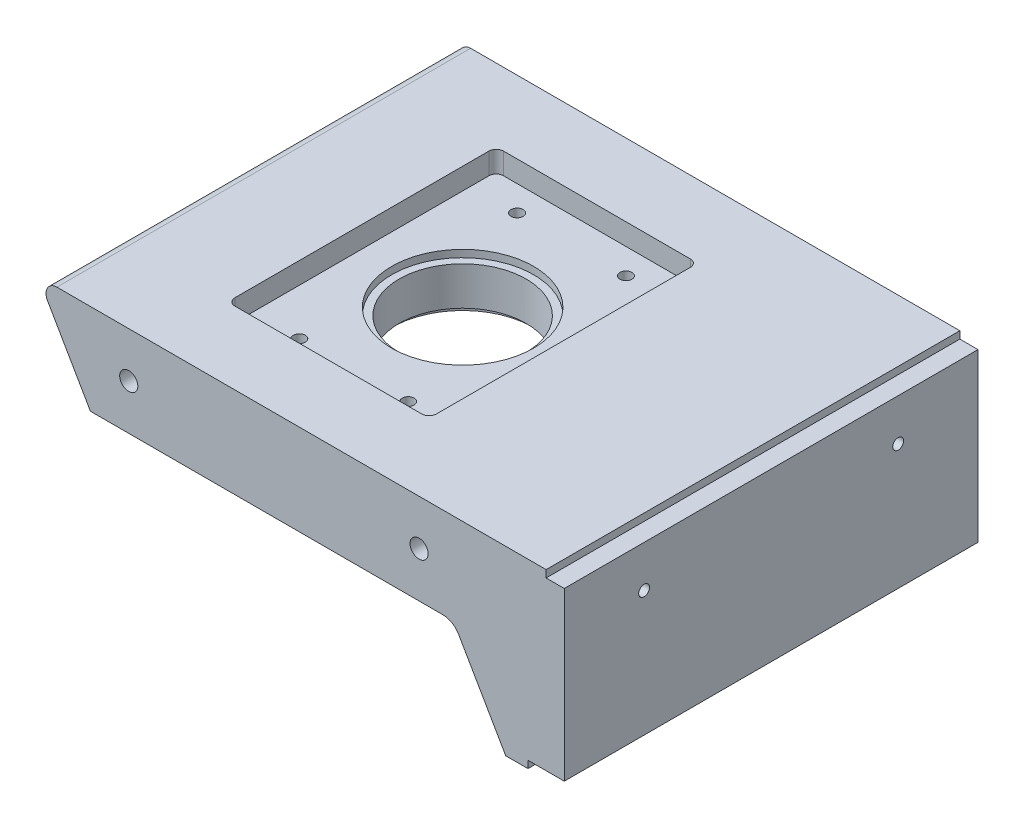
ISO-10303-21;
HEADER;
FILE_DESCRIPTION(('STEP AP214'),'2;1');
FILE_NAME('part.step','',(''),(''),'','','');
FILE_SCHEMA(('AUTOMOTIVE_DESIGN { 1 0 10303 214 1 1 1 1 }'));
ENDSEC;
DATA;
#1=APPLICATION_CONTEXT('core data for automotive mechanical design processes');
#2=APPLICATION_PROTOCOL_DEFINITION('international standard','automotive_design',2000,#1);
#3=PRODUCT_CONTEXT('',#1,'mechanical');
#4=PRODUCT('Part','Part','',(#3));
#5=PRODUCT_RELATED_PRODUCT_CATEGORY('part','',(#4));
#6=PRODUCT_DEFINITION_FORMATION('','',#4);
#7=PRODUCT_DEFINITION_CONTEXT('part definition',#1,'design');
#8=PRODUCT_DEFINITION('design','',#6,#7);
#9=PRODUCT_DEFINITION_SHAPE('','',#8);
#10=(LENGTH_UNIT() NAMED_UNIT(*) SI_UNIT(.MILLI.,.METRE.));
#11=(NAMED_UNIT(*) PLANE_ANGLE_UNIT() SI_UNIT($,.RADIAN.));
#12=(NAMED_UNIT(*) SI_UNIT($,.STERADIAN.) SOLID_ANGLE_UNIT());
#13=UNCERTAINTY_MEASURE_WITH_UNIT(LENGTH_MEASURE(1.E-05),#10,'distance_accuracy_value','');
#14=(GEOMETRIC_REPRESENTATION_CONTEXT(3) GLOBAL_UNCERTAINTY_ASSIGNED_CONTEXT((#13)) GLOBAL_UNIT_ASSIGNED_CONTEXT((#10,
#11,#12)) REPRESENTATION_CONTEXT('',''));
#15=CARTESIAN_POINT('',(0.,0.,0.));
#16=DIRECTION('',(0.,0.,1.));
#17=DIRECTION('',(1.,0.,0.));
#18=AXIS2_PLACEMENT_3D('',#15,#16,#17);
#19=CARTESIAN_POINT('',(0.,-37.5000000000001,0.));
#20=DIRECTION('',(0.,1.,0.));
#21=DIRECTION('',(-1.,0.,0.));
#22=AXIS2_PLACEMENT_3D('',#19,#20,#21);
#23=CYLINDRICAL_SURFACE('',#22,17.5);
#24=CARTESIAN_POINT('',(0.,4.59999999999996,0.));
#25=DIRECTION('',(0.,1.,0.));
#26=DIRECTION('',(0.,0.,1.));
#27=AXIS2_PLACEMENT_3D('',#24,#25,#26);
#28=CIRCLE('',#27,17.5);
#29=CARTESIAN_POINT('',(0.,4.59999999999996,17.5));
#30=VERTEX_POINT('',#29);
#31=EDGE_CURVE('E369',#30,#30,#28,.F.);
#32=ORIENTED_EDGE('',*,*,#31,.F.);
#33=EDGE_LOOP('',(#32));
#34=FACE_BOUND('',#33,.T.);
#35=CARTESIAN_POINT('',(0.,-6.00000000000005,0.));
#36=DIRECTION('',(0.,-1.,0.));
#37=DIRECTION('',(1.,0.,0.));
#38=AXIS2_PLACEMENT_3D('',#35,#36,#37);
#39=CIRCLE('',#38,17.5);
#40=CARTESIAN_POINT('',(17.5,-6.00000000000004,0.));
#41=VERTEX_POINT('',#40);
#42=EDGE_CURVE('E40',#41,#41,#39,.F.);
#43=ORIENTED_EDGE('',*,*,#42,.F.);
#44=EDGE_LOOP('',(#43));
#45=FACE_BOUND('',#44,.T.);
#46=ADVANCED_FACE('F36',(#34,#45),#23,.F.);
#47=CARTESIAN_POINT('',(80.,12.5,57.));
#48=DIRECTION('',(-1.,0.,0.));
#49=DIRECTION('',(0.,0.,1.));
#50=AXIS2_PLACEMENT_3D('',#47,#48,#49);
#51=PLANE('',#50);
#52=DIRECTION('',(0.,1.,0.));
#53=VECTOR('',#52,1.);
#54=CARTESIAN_POINT('',(80.,12.5,-57.));
#55=LINE('',#54,#53);
#56=CARTESIAN_POINT('',(80.,10.5,-57.));
#57=VERTEX_POINT('',#56);
#58=CARTESIAN_POINT('',(80.,12.5,-57.));
#59=VERTEX_POINT('',#58);
#60=EDGE_CURVE('E447',#57,#59,#55,.T.);
#61=ORIENTED_EDGE('',*,*,#60,.T.);
#62=DIRECTION('',(0.,0.,-1.));
#63=VECTOR('',#62,1.);
#64=CARTESIAN_POINT('',(80.,12.5,57.));
#65=LINE('',#64,#63);
#66=CARTESIAN_POINT('',(80.,12.5,57.));
#67=VERTEX_POINT('',#66);
#68=EDGE_CURVE('E502',#67,#59,#65,.T.);
#69=ORIENTED_EDGE('',*,*,#68,.F.);
#70=DIRECTION('',(0.,1.,0.));
#71=VECTOR('',#70,1.);
#72=CARTESIAN_POINT('',(80.,12.5,57.));
#73=LINE('',#72,#71);
#74=CARTESIAN_POINT('',(80.,10.5,57.));
#75=VERTEX_POINT('',#74);
#76=EDGE_CURVE('E451',#75,#67,#73,.T.);
#77=ORIENTED_EDGE('',*,*,#76,.F.);
#78=DIRECTION('',(0.,0.,-1.));
#79=VECTOR('',#78,1.);
#80=CARTESIAN_POINT('',(80.,10.5,57.));
#81=LINE('',#80,#79);
#82=EDGE_CURVE('E472',#75,#57,#81,.T.);
#83=ORIENTED_EDGE('',*,*,#82,.T.);
#84=EDGE_LOOP('',(#61,#69,#77,#83));
#85=FACE_BOUND('',#84,.T.);
#86=ADVANCED_FACE('F634',(#85),#51,.F.);
#87=CARTESIAN_POINT('',(-60.,12.5,57.));
#88=DIRECTION('',(0.,-1.,0.));
#89=DIRECTION('',(0.,0.,-1.));
#90=AXIS2_PLACEMENT_3D('',#87,#88,#89);
#91=PLANE('',#90);
#92=DIRECTION('',(-1.,0.,0.));
#93=VECTOR('',#92,1.);
#94=CARTESIAN_POINT('',(-27.75,12.5,-37.));
#95=LINE('',#94,#93);
#96=CARTESIAN_POINT('',(25.75,12.5,-37.));
#97=VERTEX_POINT('',#96);
#98=CARTESIAN_POINT('',(-25.75,12.5,-37.));
#99=VERTEX_POINT('',#98);
#100=EDGE_CURVE('E389',#97,#99,#95,.T.);
#101=ORIENTED_EDGE('',*,*,#100,.F.);
#102=CARTESIAN_POINT('',(25.75,12.5,-35.));
#103=DIRECTION('',(0.,-1.,0.));
#104=DIRECTION('',(0.,0.,-1.));
#105=AXIS2_PLACEMENT_3D('',#102,#103,#104);
#106=CIRCLE('',#105,2.);
#107=CARTESIAN_POINT('',(27.75,12.5,-35.));
#108=VERTEX_POINT('',#107);
#109=EDGE_CURVE('E555',#97,#108,#106,.T.);
#110=ORIENTED_EDGE('',*,*,#109,.T.);
#111=DIRECTION('',(0.,0.,-1.));
#112=VECTOR('',#111,1.);
#113=CARTESIAN_POINT('',(27.75,12.5,37.));
#114=LINE('',#113,#112);
#115=CARTESIAN_POINT('',(27.75,12.5,35.));
#116=VERTEX_POINT('',#115);
#117=EDGE_CURVE('E386',#116,#108,#114,.T.);
#118=ORIENTED_EDGE('',*,*,#117,.F.);
#119=CARTESIAN_POINT('',(25.75,12.5,35.));
#120=DIRECTION('',(0.,-1.,0.));
#121=DIRECTION('',(0.,0.,-1.));
#122=AXIS2_PLACEMENT_3D('',#119,#120,#121);
#123=CIRCLE('',#122,2.);
#124=CARTESIAN_POINT('',(25.75,12.5,37.));
#125=VERTEX_POINT('',#124);
#126=EDGE_CURVE('E553',#116,#125,#123,.T.);
#127=ORIENTED_EDGE('',*,*,#126,.T.);
#128=DIRECTION('',(1.,0.,0.));
#129=VECTOR('',#128,1.);
#130=CARTESIAN_POINT('',(-27.75,12.5,37.));
#131=LINE('',#130,#129);
#132=CARTESIAN_POINT('',(-25.75,12.5,37.));
#133=VERTEX_POINT('',#132);
#134=EDGE_CURVE('E376',#133,#125,#131,.T.);
#135=ORIENTED_EDGE('',*,*,#134,.F.);
#136=CARTESIAN_POINT('',(-25.75,12.5,35.));
#137=DIRECTION('',(0.,-1.,0.));
#138=DIRECTION('',(0.,0.,-1.));
#139=AXIS2_PLACEMENT_3D('',#136,#137,#138);
#140=CIRCLE('',#139,2.);
#141=CARTESIAN_POINT('',(-27.75,12.5,35.));
#142=VERTEX_POINT('',#141);
#143=EDGE_CURVE('E557',#133,#142,#140,.T.);
#144=ORIENTED_EDGE('',*,*,#143,.T.);
#145=DIRECTION('',(0.,0.,1.));
#146=VECTOR('',#145,1.);
#147=CARTESIAN_POINT('',(-27.75,12.5,37.));
#148=LINE('',#147,#146);
#149=CARTESIAN_POINT('',(-27.75,12.5,-35.));
#150=VERTEX_POINT('',#149);
#151=EDGE_CURVE('E392',#150,#142,#148,.T.);
#152=ORIENTED_EDGE('',*,*,#151,.F.);
#153=CARTESIAN_POINT('',(-25.75,12.5,-35.));
#154=DIRECTION('',(0.,-1.,0.));
#155=DIRECTION('',(0.,0.,-1.));
#156=AXIS2_PLACEMENT_3D('',#153,#154,#155);
#157=CIRCLE('',#156,2.);
#158=EDGE_CURVE('E559',#150,#99,#157,.T.);
#159=ORIENTED_EDGE('',*,*,#158,.T.);
#160=EDGE_LOOP('',(#101,#110,#118,#127,#135,#144,#152,#159));
#161=FACE_BOUND('',#160,.T.);
#162=DIRECTION('',(-1.,0.,0.));
#163=VECTOR('',#162,1.);
#164=CARTESIAN_POINT('',(-60.,12.5,-57.));
#165=LINE('',#164,#163);
#166=CARTESIAN_POINT('',(-54.8038475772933,12.5,-57.));
#167=VERTEX_POINT('',#166);
#168=EDGE_CURVE('E475',#59,#167,#165,.T.);
#169=ORIENTED_EDGE('',*,*,#168,.T.);
#170=DIRECTION('',(0.,0.,-1.));
#171=VECTOR('',#170,1.);
#172=CARTESIAN_POINT('',(-54.8038475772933,12.5,57.));
#173=LINE('',#172,#171);
#174=CARTESIAN_POINT('',(-54.8038475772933,12.5,57.));
#175=VERTEX_POINT('',#174);
#176=EDGE_CURVE('E510',#167,#175,#173,.F.);
#177=ORIENTED_EDGE('',*,*,#176,.T.);
#178=DIRECTION('',(-1.,0.,0.));
#179=VECTOR('',#178,1.);
#180=CARTESIAN_POINT('',(-60.,12.5,57.));
#181=LINE('',#180,#179);
#182=EDGE_CURVE('E454',#67,#175,#181,.T.);
#183=ORIENTED_EDGE('',*,*,#182,.F.);
#184=ORIENTED_EDGE('',*,*,#68,.T.);
#185=EDGE_LOOP('',(#169,#177,#183,#184));
#186=FACE_BOUND('',#185,.T.);
#187=ADVANCED_FACE('F640',(#161,#186),#91,.F.);
#188=CARTESIAN_POINT('',(-45.5662432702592,-12.5000000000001,57.));
#189=DIRECTION('',(0.866025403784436,0.500000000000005,0.));
#190=DIRECTION('',(-0.500000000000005,0.866025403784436,0.));
#191=AXIS2_PLACEMENT_3D('',#188,#189,#190);
#192=PLANE('',#191);
#193=DIRECTION('',(0.500000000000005,-0.866025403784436,0.));
#194=VECTOR('',#193,1.);
#195=CARTESIAN_POINT('',(-45.5662432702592,-12.5000000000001,57.));
#196=LINE('',#195,#194);
#197=CARTESIAN_POINT('',(-57.4019237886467,7.99999999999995,57.));
#198=VERTEX_POINT('',#197);
#199=CARTESIAN_POINT('',(-45.5662432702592,-12.5000000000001,57.));
#200=VERTEX_POINT('',#199);
#201=EDGE_CURVE('E458',#198,#200,#196,.T.);
#202=ORIENTED_EDGE('',*,*,#201,.F.);
#203=DIRECTION('',(0.,0.,-1.));
#204=VECTOR('',#203,1.);
#205=CARTESIAN_POINT('',(-57.4019237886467,7.99999999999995,57.));
#206=LINE('',#205,#204);
#207=CARTESIAN_POINT('',(-57.4019237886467,7.99999999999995,-57.));
#208=VERTEX_POINT('',#207);
#209=EDGE_CURVE('E505',#198,#208,#206,.T.);
#210=ORIENTED_EDGE('',*,*,#209,.T.);
#211=DIRECTION('',(0.500000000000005,-0.866025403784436,0.));
#212=VECTOR('',#211,1.);
#213=CARTESIAN_POINT('',(-45.5662432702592,-12.5000000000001,-57.));
#214=LINE('',#213,#212);
#215=CARTESIAN_POINT('',(-45.5662432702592,-12.5000000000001,-57.));
#216=VERTEX_POINT('',#215);
#217=EDGE_CURVE('E478',#208,#216,#214,.T.);
#218=ORIENTED_EDGE('',*,*,#217,.T.);
#219=DIRECTION('',(0.,0.,-1.));
#220=VECTOR('',#219,1.);
#221=CARTESIAN_POINT('',(-45.5662432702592,-12.5000000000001,57.));
#222=LINE('',#221,#220);
#223=EDGE_CURVE('E499',#200,#216,#222,.T.);
#224=ORIENTED_EDGE('',*,*,#223,.F.);
#225=EDGE_LOOP('',(#202,#210,#218,#224));
#226=FACE_BOUND('',#225,.T.);
#227=ADVANCED_FACE('F676',(#226),#192,.F.);
#228=CARTESIAN_POINT('',(54.4362432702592,-12.5,57.));
#229=DIRECTION('',(0.,1.,0.));
#230=DIRECTION('',(-1.,0.,0.));
#231=AXIS2_PLACEMENT_3D('',#228,#229,#230);
#232=PLANE('',#231);
#233=DIRECTION('',(-1.,0.,0.));
#234=VECTOR('',#233,1.);
#235=CARTESIAN_POINT('',(-27.75,-12.5,47.));
#236=LINE('',#235,#234);
#237=CARTESIAN_POINT('',(25.75,-12.5,47.));
#238=VERTEX_POINT('',#237);
#239=CARTESIAN_POINT('',(-25.75,-12.5,47.));
#240=VERTEX_POINT('',#239);
#241=EDGE_CURVE('E335',#238,#240,#236,.T.);
#242=ORIENTED_EDGE('',*,*,#241,.F.);
#243=CARTESIAN_POINT('',(25.75,-12.5,45.));
#244=DIRECTION('',(0.,1.,0.));
#245=DIRECTION('',(-1.,0.,0.));
#246=AXIS2_PLACEMENT_3D('',#243,#244,#245);
#247=CIRCLE('',#246,2.);
#248=CARTESIAN_POINT('',(27.75,-12.5,45.));
#249=VERTEX_POINT('',#248);
#250=EDGE_CURVE('E588',#238,#249,#247,.T.);
#251=ORIENTED_EDGE('',*,*,#250,.T.);
#252=DIRECTION('',(0.,0.,1.));
#253=VECTOR('',#252,1.);
#254=CARTESIAN_POINT('',(27.75,-12.5,-47.));
#255=LINE('',#254,#253);
#256=CARTESIAN_POINT('',(27.75,-12.5,-45.));
#257=VERTEX_POINT('',#256);
#258=EDGE_CURVE('E332',#257,#249,#255,.T.);
#259=ORIENTED_EDGE('',*,*,#258,.F.);
#260=CARTESIAN_POINT('',(25.75,-12.5,-45.));
#261=DIRECTION('',(0.,1.,0.));
#262=DIRECTION('',(-1.,0.,0.));
#263=AXIS2_PLACEMENT_3D('',#260,#261,#262);
#264=CIRCLE('',#263,2.);
#265=CARTESIAN_POINT('',(25.75,-12.5,-47.));
#266=VERTEX_POINT('',#265);
#267=EDGE_CURVE('E590',#257,#266,#264,.T.);
#268=ORIENTED_EDGE('',*,*,#267,.T.);
#269=DIRECTION('',(1.,0.,0.));
#270=VECTOR('',#269,1.);
#271=CARTESIAN_POINT('',(-27.75,-12.5,-47.));
#272=LINE('',#271,#270);
#273=CARTESIAN_POINT('',(-25.75,-12.5,-47.));
#274=VERTEX_POINT('',#273);
#275=EDGE_CURVE('E322',#274,#266,#272,.T.);
#276=ORIENTED_EDGE('',*,*,#275,.F.);
#277=CARTESIAN_POINT('',(-25.75,-12.5,-45.));
#278=DIRECTION('',(0.,1.,0.));
#279=DIRECTION('',(-1.,0.,0.));
#280=AXIS2_PLACEMENT_3D('',#277,#278,#279);
#281=CIRCLE('',#280,2.);
#282=CARTESIAN_POINT('',(-27.75,-12.5,-45.));
#283=VERTEX_POINT('',#282);
#284=EDGE_CURVE('E45',#274,#283,#281,.T.);
#285=ORIENTED_EDGE('',*,*,#284,.T.);
#286=DIRECTION('',(0.,0.,-1.));
#287=VECTOR('',#286,1.);
#288=CARTESIAN_POINT('',(-27.75,-12.5,-47.));
#289=LINE('',#288,#287);
#290=CARTESIAN_POINT('',(-27.75,-12.5,45.));
#291=VERTEX_POINT('',#290);
#292=EDGE_CURVE('E338',#291,#283,#289,.T.);
#293=ORIENTED_EDGE('',*,*,#292,.F.);
#294=CARTESIAN_POINT('',(-25.75,-12.5,45.));
#295=DIRECTION('',(0.,1.,0.));
#296=DIRECTION('',(-1.,0.,0.));
#297=AXIS2_PLACEMENT_3D('',#294,#295,#296);
#298=CIRCLE('',#297,2.);
#299=EDGE_CURVE('E11',#291,#240,#298,.T.);
#300=ORIENTED_EDGE('',*,*,#299,.T.);
#301=EDGE_LOOP('',(#242,#251,#259,#268,#276,#285,#293,#300));
#302=FACE_BOUND('',#301,.T.);
#303=DIRECTION('',(1.,0.,0.));
#304=VECTOR('',#303,1.);
#305=CARTESIAN_POINT('',(54.4362432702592,-12.5,-57.));
#306=LINE('',#305,#304);
#307=CARTESIAN_POINT('',(51.5494919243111,-12.5,-57.));
#308=VERTEX_POINT('',#307);
#309=EDGE_CURVE('E480',#216,#308,#306,.T.);
#310=ORIENTED_EDGE('',*,*,#309,.T.);
#311=DIRECTION('',(0.,0.,-1.));
#312=VECTOR('',#311,1.);
#313=CARTESIAN_POINT('',(51.5494919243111,-12.5,57.));
#314=LINE('',#313,#312);
#315=CARTESIAN_POINT('',(51.5494919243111,-12.5,57.));
#316=VERTEX_POINT('',#315);
#317=EDGE_CURVE('E517',#308,#316,#314,.F.);
#318=ORIENTED_EDGE('',*,*,#317,.T.);
#319=DIRECTION('',(1.,0.,0.));
#320=VECTOR('',#319,1.);
#321=CARTESIAN_POINT('',(54.4362432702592,-12.5,57.));
#322=LINE('',#321,#320);
#323=EDGE_CURVE('E460',#200,#316,#322,.T.);
#324=ORIENTED_EDGE('',*,*,#323,.F.);
#325=ORIENTED_EDGE('',*,*,#223,.T.);
#326=EDGE_LOOP('',(#310,#318,#324,#325));
#327=FACE_BOUND('',#326,.T.);
#328=ADVANCED_FACE('F594',(#302,#327),#232,.F.);
#329=CARTESIAN_POINT('',(68.87,-37.5,57.));
#330=DIRECTION('',(0.866025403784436,0.500000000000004,0.));
#331=DIRECTION('',(-0.500000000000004,0.866025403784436,0.));
#332=AXIS2_PLACEMENT_3D('',#329,#330,#331);
#333=PLANE('',#332);
#334=DIRECTION('',(0.500000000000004,-0.866025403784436,0.));
#335=VECTOR('',#334,1.);
#336=CARTESIAN_POINT('',(68.87,-37.5,57.));
#337=LINE('',#336,#335);
#338=CARTESIAN_POINT('',(55.8796189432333,-15.,57.));
#339=VERTEX_POINT('',#338);
#340=CARTESIAN_POINT('',(68.87,-37.5,57.));
#341=VERTEX_POINT('',#340);
#342=EDGE_CURVE('E463',#339,#341,#337,.T.);
#343=ORIENTED_EDGE('',*,*,#342,.F.);
#344=DIRECTION('',(0.,0.,-1.));
#345=VECTOR('',#344,1.);
#346=CARTESIAN_POINT('',(55.8796189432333,-15.,-57.));
#347=LINE('',#346,#345);
#348=CARTESIAN_POINT('',(55.8796189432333,-15.,-57.));
#349=VERTEX_POINT('',#348);
#350=EDGE_CURVE('E514',#339,#349,#347,.T.);
#351=ORIENTED_EDGE('',*,*,#350,.T.);
#352=DIRECTION('',(0.500000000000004,-0.866025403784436,0.));
#353=VECTOR('',#352,1.);
#354=CARTESIAN_POINT('',(68.87,-37.5,-57.));
#355=LINE('',#354,#353);
#356=CARTESIAN_POINT('',(68.87,-37.5,-57.));
#357=VERTEX_POINT('',#356);
#358=EDGE_CURVE('E483',#349,#357,#355,.T.);
#359=ORIENTED_EDGE('',*,*,#358,.T.);
#360=DIRECTION('',(0.,0.,-1.));
#361=VECTOR('',#360,1.);
#362=CARTESIAN_POINT('',(68.87,-37.5,57.));
#363=LINE('',#362,#361);
#364=EDGE_CURVE('E496',#341,#357,#363,.T.);
#365=ORIENTED_EDGE('',*,*,#364,.F.);
#366=EDGE_LOOP('',(#343,#351,#359,#365));
#367=FACE_BOUND('',#366,.T.);
#368=ADVANCED_FACE('F669',(#367),#333,.F.);
#369=CARTESIAN_POINT('',(85.,-37.5,57.));
#370=DIRECTION('',(0.,1.,0.));
#371=DIRECTION('',(-1.,0.,0.));
#372=AXIS2_PLACEMENT_3D('',#369,#370,#371);
#373=PLANE('',#372);
#374=DIRECTION('',(1.,0.,0.));
#375=VECTOR('',#374,1.);
#376=CARTESIAN_POINT('',(85.,-37.5,-57.));
#377=LINE('',#376,#375);
#378=CARTESIAN_POINT('',(75.,-37.5,-57.));
#379=VERTEX_POINT('',#378);
#380=EDGE_CURVE('E485',#357,#379,#377,.T.);
#381=ORIENTED_EDGE('',*,*,#380,.T.);
#382=DIRECTION('',(0.,0.,1.));
#383=VECTOR('',#382,1.);
#384=CARTESIAN_POINT('',(75.,-37.5,-57.));
#385=LINE('',#384,#383);
#386=CARTESIAN_POINT('',(75.,-37.5,57.));
#387=VERTEX_POINT('',#386);
#388=EDGE_CURVE('E444',#379,#387,#385,.T.);
#389=ORIENTED_EDGE('',*,*,#388,.T.);
#390=DIRECTION('',(1.,0.,0.));
#391=VECTOR('',#390,1.);
#392=CARTESIAN_POINT('',(85.,-37.5,57.));
#393=LINE('',#392,#391);
#394=EDGE_CURVE('E465',#341,#387,#393,.T.);
#395=ORIENTED_EDGE('',*,*,#394,.F.);
#396=ORIENTED_EDGE('',*,*,#364,.T.);
#397=EDGE_LOOP('',(#381,#389,#395,#396));
#398=FACE_BOUND('',#397,.T.);
#399=ADVANCED_FACE('F665',(#398),#373,.F.);
#400=CARTESIAN_POINT('',(85.,-37.5,57.));
#401=DIRECTION('',(-1.,0.,0.));
#402=DIRECTION('',(0.,0.,1.));
#403=AXIS2_PLACEMENT_3D('',#400,#401,#402);
#404=PLANE('',#403);
#405=CARTESIAN_POINT('',(85.,-0.999999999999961,35.));
#406=DIRECTION('',(1.,0.,0.));
#407=DIRECTION('',(0.,0.,-1.));
#408=AXIS2_PLACEMENT_3D('',#405,#406,#407);
#409=CIRCLE('',#408,1.49999999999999);
#410=CARTESIAN_POINT('',(85.,-0.999999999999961,33.5));
#411=VERTEX_POINT('',#410);
#412=EDGE_CURVE('E278',#411,#411,#409,.T.);
#413=ORIENTED_EDGE('',*,*,#412,.F.);
#414=EDGE_LOOP('',(#413));
#415=FACE_BOUND('',#414,.T.);
#416=CARTESIAN_POINT('',(85.,-0.999999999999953,-35.));
#417=DIRECTION('',(1.,0.,0.));
#418=DIRECTION('',(0.,0.,-1.));
#419=AXIS2_PLACEMENT_3D('',#416,#417,#418);
#420=CIRCLE('',#419,1.49999999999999);
#421=CARTESIAN_POINT('',(85.,-0.999999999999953,-36.5));
#422=VERTEX_POINT('',#421);
#423=EDGE_CURVE('E277',#422,#422,#420,.T.);
#424=ORIENTED_EDGE('',*,*,#423,.F.);
#425=EDGE_LOOP('',(#424));
#426=FACE_BOUND('',#425,.T.);
#427=DIRECTION('',(0.,1.,0.));
#428=VECTOR('',#427,1.);
#429=CARTESIAN_POINT('',(85.,-37.5,57.));
#430=LINE('',#429,#428);
#431=CARTESIAN_POINT('',(85.,-35.5,57.));
#432=VERTEX_POINT('',#431);
#433=CARTESIAN_POINT('',(85.,10.5,57.));
#434=VERTEX_POINT('',#433);
#435=EDGE_CURVE('E468',#432,#434,#430,.T.);
#436=ORIENTED_EDGE('',*,*,#435,.F.);
#437=DIRECTION('',(0.,0.,1.));
#438=VECTOR('',#437,1.);
#439=CARTESIAN_POINT('',(85.,-35.5,-57.));
#440=LINE('',#439,#438);
#441=CARTESIAN_POINT('',(85.,-35.5,-57.));
#442=VERTEX_POINT('',#441);
#443=EDGE_CURVE('E440',#442,#432,#440,.T.);
#444=ORIENTED_EDGE('',*,*,#443,.F.);
#445=DIRECTION('',(0.,1.,0.));
#446=VECTOR('',#445,1.);
#447=CARTESIAN_POINT('',(85.,-37.5,-57.));
#448=LINE('',#447,#446);
#449=CARTESIAN_POINT('',(85.,10.5,-57.));
#450=VERTEX_POINT('',#449);
#451=EDGE_CURVE('E488',#442,#450,#448,.T.);
#452=ORIENTED_EDGE('',*,*,#451,.T.);
#453=DIRECTION('',(0.,0.,-1.));
#454=VECTOR('',#453,1.);
#455=CARTESIAN_POINT('',(85.,10.5,57.));
#456=LINE('',#455,#454);
#457=EDGE_CURVE('E493',#434,#450,#456,.T.);
#458=ORIENTED_EDGE('',*,*,#457,.F.);
#459=EDGE_LOOP('',(#436,#444,#452,#458));
#460=FACE_BOUND('',#459,.T.);
#461=ADVANCED_FACE('F661',(#415,#426,#460),#404,.F.);
#462=CARTESIAN_POINT('',(80.,10.5,57.));
#463=DIRECTION('',(0.,-1.,0.));
#464=DIRECTION('',(0.,0.,-1.));
#465=AXIS2_PLACEMENT_3D('',#462,#463,#464);
#466=PLANE('',#465);
#467=DIRECTION('',(-1.,0.,0.));
#468=VECTOR('',#467,1.);
#469=CARTESIAN_POINT('',(80.,10.5,-57.));
#470=LINE('',#469,#468);
#471=EDGE_CURVE('E455',#450,#57,#470,.T.);
#472=ORIENTED_EDGE('',*,*,#471,.T.);
#473=ORIENTED_EDGE('',*,*,#82,.F.);
#474=DIRECTION('',(-1.,0.,0.));
#475=VECTOR('',#474,1.);
#476=CARTESIAN_POINT('',(80.,10.5,57.));
#477=LINE('',#476,#475);
#478=EDGE_CURVE('E470',#434,#75,#477,.T.);
#479=ORIENTED_EDGE('',*,*,#478,.F.);
#480=ORIENTED_EDGE('',*,*,#457,.T.);
#481=EDGE_LOOP('',(#472,#473,#479,#480));
#482=FACE_BOUND('',#481,.T.);
#483=ADVANCED_FACE('F653',(#482),#466,.F.);
#484=CARTESIAN_POINT('',(0.,0.,57.));
#485=DIRECTION('',(0.,0.,1.));
#486=DIRECTION('',(1.,0.,0.));
#487=AXIS2_PLACEMENT_3D('',#484,#485,#486);
#488=PLANE('',#487);
#489=CARTESIAN_POINT('',(-35.,0.,57.));
#490=DIRECTION('',(0.,0.,1.));
#491=DIRECTION('',(1.,0.,0.));
#492=AXIS2_PLACEMENT_3D('',#489,#490,#491);
#493=CIRCLE('',#492,2.5);
#494=CARTESIAN_POINT('',(-32.5,0.,57.));
#495=VERTEX_POINT('',#494);
#496=EDGE_CURVE('E420',#495,#495,#493,.T.);
#497=ORIENTED_EDGE('',*,*,#496,.F.);
#498=EDGE_LOOP('',(#497));
#499=FACE_BOUND('',#498,.T.);
#500=CARTESIAN_POINT('',(45.,0.,57.));
#501=DIRECTION('',(0.,0.,1.));
#502=DIRECTION('',(1.,0.,0.));
#503=AXIS2_PLACEMENT_3D('',#500,#501,#502);
#504=CIRCLE('',#503,2.5);
#505=CARTESIAN_POINT('',(47.5,0.,57.));
#506=VERTEX_POINT('',#505);
#507=EDGE_CURVE('E426',#506,#506,#504,.T.);
#508=ORIENTED_EDGE('',*,*,#507,.F.);
#509=EDGE_LOOP('',(#508));
#510=FACE_BOUND('',#509,.T.);
#511=ORIENTED_EDGE('',*,*,#182,.T.);
#512=CARTESIAN_POINT('',(-54.8038475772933,9.49999999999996,57.));
#513=DIRECTION('',(0.,0.,1.));
#514=DIRECTION('',(1.,0.,0.));
#515=AXIS2_PLACEMENT_3D('',#512,#513,#514);
#516=CIRCLE('',#515,3.);
#517=EDGE_CURVE('E512',#175,#198,#516,.T.);
#518=ORIENTED_EDGE('',*,*,#517,.T.);
#519=ORIENTED_EDGE('',*,*,#201,.T.);
#520=ORIENTED_EDGE('',*,*,#323,.T.);
#521=CARTESIAN_POINT('',(51.5494919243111,-17.5,57.));
#522=DIRECTION('',(0.,0.,1.));
#523=DIRECTION('',(1.,0.,0.));
#524=AXIS2_PLACEMENT_3D('',#521,#522,#523);
#525=CIRCLE('',#524,5.);
#526=EDGE_CURVE('E521',#316,#339,#525,.F.);
#527=ORIENTED_EDGE('',*,*,#526,.T.);
#528=ORIENTED_EDGE('',*,*,#342,.T.);
#529=ORIENTED_EDGE('',*,*,#394,.T.);
#530=DIRECTION('',(0.,-1.,0.));
#531=VECTOR('',#530,1.);
#532=CARTESIAN_POINT('',(75.,-35.5,57.));
#533=LINE('',#532,#531);
#534=CARTESIAN_POINT('',(75.,-35.5,57.));
#535=VERTEX_POINT('',#534);
#536=EDGE_CURVE('E437',#535,#387,#533,.T.);
#537=ORIENTED_EDGE('',*,*,#536,.F.);
#538=DIRECTION('',(-1.,0.,0.));
#539=VECTOR('',#538,1.);
#540=CARTESIAN_POINT('',(85.,-35.5,57.));
#541=LINE('',#540,#539);
#542=EDGE_CURVE('E432',#432,#535,#541,.T.);
#543=ORIENTED_EDGE('',*,*,#542,.F.);
#544=ORIENTED_EDGE('',*,*,#435,.T.);
#545=ORIENTED_EDGE('',*,*,#478,.T.);
#546=ORIENTED_EDGE('',*,*,#76,.T.);
#547=EDGE_LOOP('',(#511,#518,#519,#520,#527,#528,#529,#537,#543,#544,#545,#546));
#548=FACE_BOUND('',#547,.T.);
#549=ADVANCED_FACE('F649',(#499,#510,#548),#488,.T.);
#550=CARTESIAN_POINT('',(0.,0.,-57.));
#551=DIRECTION('',(0.,0.,1.));
#552=DIRECTION('',(1.,0.,0.));
#553=AXIS2_PLACEMENT_3D('',#550,#551,#552);
#554=PLANE('',#553);
#555=CARTESIAN_POINT('',(-35.,0.,-57.));
#556=DIRECTION('',(0.,0.,-1.));
#557=DIRECTION('',(-1.,0.,0.));
#558=AXIS2_PLACEMENT_3D('',#555,#556,#557);
#559=CIRCLE('',#558,2.5);
#560=CARTESIAN_POINT('',(-37.5,0.,-57.));
#561=VERTEX_POINT('',#560);
#562=EDGE_CURVE('E408',#561,#561,#559,.T.);
#563=ORIENTED_EDGE('',*,*,#562,.F.);
#564=EDGE_LOOP('',(#563));
#565=FACE_BOUND('',#564,.T.);
#566=CARTESIAN_POINT('',(45.,0.,-57.));
#567=DIRECTION('',(0.,0.,-1.));
#568=DIRECTION('',(-1.,0.,0.));
#569=AXIS2_PLACEMENT_3D('',#566,#567,#568);
#570=CIRCLE('',#569,2.5);
#571=CARTESIAN_POINT('',(42.5,0.,-57.));
#572=VERTEX_POINT('',#571);
#573=EDGE_CURVE('E414',#572,#572,#570,.T.);
#574=ORIENTED_EDGE('',*,*,#573,.F.);
#575=EDGE_LOOP('',(#574));
#576=FACE_BOUND('',#575,.T.);
#577=ORIENTED_EDGE('',*,*,#217,.F.);
#578=CARTESIAN_POINT('',(-54.8038475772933,9.49999999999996,-57.));
#579=DIRECTION('',(0.,0.,1.));
#580=DIRECTION('',(1.,0.,0.));
#581=AXIS2_PLACEMENT_3D('',#578,#579,#580);
#582=CIRCLE('',#581,3.);
#583=EDGE_CURVE('E508',#208,#167,#582,.F.);
#584=ORIENTED_EDGE('',*,*,#583,.T.);
#585=ORIENTED_EDGE('',*,*,#168,.F.);
#586=ORIENTED_EDGE('',*,*,#60,.F.);
#587=ORIENTED_EDGE('',*,*,#471,.F.);
#588=ORIENTED_EDGE('',*,*,#451,.F.);
#589=DIRECTION('',(-1.,0.,0.));
#590=VECTOR('',#589,1.);
#591=CARTESIAN_POINT('',(85.,-35.5,-57.));
#592=LINE('',#591,#590);
#593=CARTESIAN_POINT('',(75.,-35.5,-57.));
#594=VERTEX_POINT('',#593);
#595=EDGE_CURVE('E433',#442,#594,#592,.T.);
#596=ORIENTED_EDGE('',*,*,#595,.T.);
#597=DIRECTION('',(0.,-1.,0.));
#598=VECTOR('',#597,1.);
#599=CARTESIAN_POINT('',(75.,-35.5,-57.));
#600=LINE('',#599,#598);
#601=EDGE_CURVE('E436',#594,#379,#600,.T.);
#602=ORIENTED_EDGE('',*,*,#601,.T.);
#603=ORIENTED_EDGE('',*,*,#380,.F.);
#604=ORIENTED_EDGE('',*,*,#358,.F.);
#605=CARTESIAN_POINT('',(51.5494919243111,-17.5,-57.));
#606=DIRECTION('',(0.,0.,1.));
#607=DIRECTION('',(1.,0.,0.));
#608=AXIS2_PLACEMENT_3D('',#605,#606,#607);
#609=CIRCLE('',#608,5.);
#610=EDGE_CURVE('E519',#349,#308,#609,.T.);
#611=ORIENTED_EDGE('',*,*,#610,.T.);
#612=ORIENTED_EDGE('',*,*,#309,.F.);
#613=EDGE_LOOP('',(#577,#584,#585,#586,#587,#588,#596,#602,#603,#604,#611,#612));
#614=FACE_BOUND('',#613,.T.);
#615=ADVANCED_FACE('F652',(#565,#576,#614),#554,.F.);
#616=CARTESIAN_POINT('',(75.,-35.5,-57.));
#617=DIRECTION('',(-1.,0.,0.));
#618=DIRECTION('',(0.,0.,1.));
#619=AXIS2_PLACEMENT_3D('',#616,#617,#618);
#620=PLANE('',#619);
#621=ORIENTED_EDGE('',*,*,#536,.T.);
#622=ORIENTED_EDGE('',*,*,#388,.F.);
#623=ORIENTED_EDGE('',*,*,#601,.F.);
#624=DIRECTION('',(0.,0.,1.));
#625=VECTOR('',#624,1.);
#626=CARTESIAN_POINT('',(75.,-35.5,-57.));
#627=LINE('',#626,#625);
#628=EDGE_CURVE('E448',#594,#535,#627,.T.);
#629=ORIENTED_EDGE('',*,*,#628,.T.);
#630=EDGE_LOOP('',(#621,#622,#623,#629));
#631=FACE_BOUND('',#630,.T.);
#632=ADVANCED_FACE('F657',(#631),#620,.F.);
#633=CARTESIAN_POINT('',(85.,-35.5,-57.));
#634=DIRECTION('',(0.,1.,0.));
#635=DIRECTION('',(-1.,0.,0.));
#636=AXIS2_PLACEMENT_3D('',#633,#634,#635);
#637=PLANE('',#636);
#638=CARTESIAN_POINT('',(80.,-35.5,37.));
#639=DIRECTION('',(0.,-1.,0.));
#640=DIRECTION('',(0.,0.,-1.));
#641=AXIS2_PLACEMENT_3D('',#638,#639,#640);
#642=CIRCLE('',#641,1.25);
#643=CARTESIAN_POINT('',(80.,-35.5,35.75));
#644=VERTEX_POINT('',#643);
#645=EDGE_CURVE('E385',#644,#644,#642,.T.);
#646=ORIENTED_EDGE('',*,*,#645,.F.);
#647=EDGE_LOOP('',(#646));
#648=FACE_BOUND('',#647,.T.);
#649=CARTESIAN_POINT('',(80.,-35.5,-37.));
#650=DIRECTION('',(0.,-1.,0.));
#651=DIRECTION('',(0.,0.,-1.));
#652=AXIS2_PLACEMENT_3D('',#649,#650,#651);
#653=CIRCLE('',#652,1.25);
#654=CARTESIAN_POINT('',(80.,-35.5,-38.25));
#655=VERTEX_POINT('',#654);
#656=EDGE_CURVE('E402',#655,#655,#653,.T.);
#657=ORIENTED_EDGE('',*,*,#656,.F.);
#658=EDGE_LOOP('',(#657));
#659=FACE_BOUND('',#658,.T.);
#660=ORIENTED_EDGE('',*,*,#542,.T.);
#661=ORIENTED_EDGE('',*,*,#628,.F.);
#662=ORIENTED_EDGE('',*,*,#595,.F.);
#663=ORIENTED_EDGE('',*,*,#443,.T.);
#664=EDGE_LOOP('',(#660,#661,#662,#663));
#665=FACE_BOUND('',#664,.T.);
#666=ADVANCED_FACE('F647',(#648,#659,#665),#637,.F.);
#667=CARTESIAN_POINT('',(45.,0.,42.));
#668=DIRECTION('',(0.,0.,1.));
#669=DIRECTION('',(1.,0.,0.));
#670=AXIS2_PLACEMENT_3D('',#667,#668,#669);
#671=CONICAL_SURFACE('',#670,2.5,1.02974425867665);
#672=CARTESIAN_POINT('',(45.,0.,40.4978484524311));
#673=VERTEX_POINT('',#672);
#674=VERTEX_LOOP('',#673);
#675=FACE_BOUND('',#674,.T.);
#676=CARTESIAN_POINT('',(45.,0.,42.));
#677=DIRECTION('',(0.,0.,1.));
#678=DIRECTION('',(1.,0.,0.));
#679=AXIS2_PLACEMENT_3D('',#676,#677,#678);
#680=CIRCLE('',#679,2.5);
#681=CARTESIAN_POINT('',(47.5,0.,42.));
#682=VERTEX_POINT('',#681);
#683=EDGE_CURVE('E429',#682,#682,#680,.T.);
#684=ORIENTED_EDGE('',*,*,#683,.T.);
#685=EDGE_LOOP('',(#684));
#686=FACE_BOUND('',#685,.T.);
#687=ADVANCED_FACE('F823',(#675,#686),#671,.F.);
#688=CARTESIAN_POINT('',(45.,0.,57.));
#689=DIRECTION('',(0.,0.,1.));
#690=DIRECTION('',(1.,0.,0.));
#691=AXIS2_PLACEMENT_3D('',#688,#689,#690);
#692=CYLINDRICAL_SURFACE('',#691,2.5);
#693=ORIENTED_EDGE('',*,*,#683,.F.);
#694=EDGE_LOOP('',(#693));
#695=FACE_BOUND('',#694,.T.);
#696=ORIENTED_EDGE('',*,*,#507,.T.);
#697=EDGE_LOOP('',(#696));
#698=FACE_BOUND('',#697,.T.);
#699=ADVANCED_FACE('F819',(#695,#698),#692,.F.);
#700=CARTESIAN_POINT('',(-35.,0.,42.));
#701=DIRECTION('',(0.,0.,1.));
#702=DIRECTION('',(1.,0.,0.));
#703=AXIS2_PLACEMENT_3D('',#700,#701,#702);
#704=CONICAL_SURFACE('',#703,2.5,1.02974425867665);
#705=CARTESIAN_POINT('',(-35.,0.,40.4978484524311));
#706=VERTEX_POINT('',#705);
#707=VERTEX_LOOP('',#706);
#708=FACE_BOUND('',#707,.T.);
#709=CARTESIAN_POINT('',(-35.,0.,42.));
#710=DIRECTION('',(0.,0.,1.));
#711=DIRECTION('',(1.,0.,0.));
#712=AXIS2_PLACEMENT_3D('',#709,#710,#711);
#713=CIRCLE('',#712,2.5);
#714=CARTESIAN_POINT('',(-32.5,0.,42.));
#715=VERTEX_POINT('',#714);
#716=EDGE_CURVE('E423',#715,#715,#713,.T.);
#717=ORIENTED_EDGE('',*,*,#716,.T.);
#718=EDGE_LOOP('',(#717));
#719=FACE_BOUND('',#718,.T.);
#720=ADVANCED_FACE('F815',(#708,#719),#704,.F.);
#721=CARTESIAN_POINT('',(-35.,0.,57.));
#722=DIRECTION('',(0.,0.,1.));
#723=DIRECTION('',(1.,0.,0.));
#724=AXIS2_PLACEMENT_3D('',#721,#722,#723);
#725=CYLINDRICAL_SURFACE('',#724,2.5);
#726=ORIENTED_EDGE('',*,*,#716,.F.);
#727=EDGE_LOOP('',(#726));
#728=FACE_BOUND('',#727,.T.);
#729=ORIENTED_EDGE('',*,*,#496,.T.);
#730=EDGE_LOOP('',(#729));
#731=FACE_BOUND('',#730,.T.);
#732=ADVANCED_FACE('F811',(#728,#731),#725,.F.);
#733=CARTESIAN_POINT('',(45.,0.,-42.));
#734=DIRECTION('',(0.,0.,-1.));
#735=DIRECTION('',(-1.,0.,0.));
#736=AXIS2_PLACEMENT_3D('',#733,#734,#735);
#737=CONICAL_SURFACE('',#736,2.5,1.02974425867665);
#738=CARTESIAN_POINT('',(45.,0.,-40.4978484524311));
#739=VERTEX_POINT('',#738);
#740=VERTEX_LOOP('',#739);
#741=FACE_BOUND('',#740,.T.);
#742=CARTESIAN_POINT('',(45.,0.,-42.));
#743=DIRECTION('',(0.,0.,-1.));
#744=DIRECTION('',(-1.,0.,0.));
#745=AXIS2_PLACEMENT_3D('',#742,#743,#744);
#746=CIRCLE('',#745,2.5);
#747=CARTESIAN_POINT('',(42.5,0.,-42.));
#748=VERTEX_POINT('',#747);
#749=EDGE_CURVE('E417',#748,#748,#746,.T.);
#750=ORIENTED_EDGE('',*,*,#749,.T.);
#751=EDGE_LOOP('',(#750));
#752=FACE_BOUND('',#751,.T.);
#753=ADVANCED_FACE('F807',(#741,#752),#737,.F.);
#754=CARTESIAN_POINT('',(45.,0.,-57.));
#755=DIRECTION('',(0.,0.,-1.));
#756=DIRECTION('',(-1.,0.,0.));
#757=AXIS2_PLACEMENT_3D('',#754,#755,#756);
#758=CYLINDRICAL_SURFACE('',#757,2.5);
#759=ORIENTED_EDGE('',*,*,#749,.F.);
#760=EDGE_LOOP('',(#759));
#761=FACE_BOUND('',#760,.T.);
#762=ORIENTED_EDGE('',*,*,#573,.T.);
#763=EDGE_LOOP('',(#762));
#764=FACE_BOUND('',#763,.T.);
#765=ADVANCED_FACE('F803',(#761,#764),#758,.F.);
#766=CARTESIAN_POINT('',(-35.,0.,-42.));
#767=DIRECTION('',(0.,0.,-1.));
#768=DIRECTION('',(-1.,0.,0.));
#769=AXIS2_PLACEMENT_3D('',#766,#767,#768);
#770=CONICAL_SURFACE('',#769,2.5,1.02974425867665);
#771=CARTESIAN_POINT('',(-35.,0.,-40.4978484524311));
#772=VERTEX_POINT('',#771);
#773=VERTEX_LOOP('',#772);
#774=FACE_BOUND('',#773,.T.);
#775=CARTESIAN_POINT('',(-35.,0.,-42.));
#776=DIRECTION('',(0.,0.,-1.));
#777=DIRECTION('',(-1.,0.,0.));
#778=AXIS2_PLACEMENT_3D('',#775,#776,#777);
#779=CIRCLE('',#778,2.5);
#780=CARTESIAN_POINT('',(-37.5,0.,-42.));
#781=VERTEX_POINT('',#780);
#782=EDGE_CURVE('E411',#781,#781,#779,.T.);
#783=ORIENTED_EDGE('',*,*,#782,.T.);
#784=EDGE_LOOP('',(#783));
#785=FACE_BOUND('',#784,.T.);
#786=ADVANCED_FACE('F799',(#774,#785),#770,.F.);
#787=CARTESIAN_POINT('',(-35.,0.,-57.));
#788=DIRECTION('',(0.,0.,-1.));
#789=DIRECTION('',(-1.,0.,0.));
#790=AXIS2_PLACEMENT_3D('',#787,#788,#789);
#791=CYLINDRICAL_SURFACE('',#790,2.5);
#792=ORIENTED_EDGE('',*,*,#782,.F.);
#793=EDGE_LOOP('',(#792));
#794=FACE_BOUND('',#793,.T.);
#795=ORIENTED_EDGE('',*,*,#562,.T.);
#796=EDGE_LOOP('',(#795));
#797=FACE_BOUND('',#796,.T.);
#798=ADVANCED_FACE('F795',(#794,#797),#791,.F.);
#799=CARTESIAN_POINT('',(80.,-28.,-37.));
#800=DIRECTION('',(0.,-1.,0.));
#801=DIRECTION('',(0.,0.,-1.));
#802=AXIS2_PLACEMENT_3D('',#799,#800,#801);
#803=CONICAL_SURFACE('',#802,1.25,1.02974425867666);
#804=CARTESIAN_POINT('',(80.,-27.2489242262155,-37.));
#805=VERTEX_POINT('',#804);
#806=VERTEX_LOOP('',#805);
#807=FACE_BOUND('',#806,.T.);
#808=CARTESIAN_POINT('',(80.,-28.,-37.));
#809=DIRECTION('',(0.,-1.,0.));
#810=DIRECTION('',(0.,0.,-1.));
#811=AXIS2_PLACEMENT_3D('',#808,#809,#810);
#812=CIRCLE('',#811,1.25);
#813=CARTESIAN_POINT('',(80.,-28.,-38.25));
#814=VERTEX_POINT('',#813);
#815=EDGE_CURVE('E405',#814,#814,#812,.T.);
#816=ORIENTED_EDGE('',*,*,#815,.T.);
#817=EDGE_LOOP('',(#816));
#818=FACE_BOUND('',#817,.T.);
#819=ADVANCED_FACE('F791',(#807,#818),#803,.F.);
#820=CARTESIAN_POINT('',(80.,-35.5,-37.));
#821=DIRECTION('',(0.,-1.,0.));
#822=DIRECTION('',(0.,0.,-1.));
#823=AXIS2_PLACEMENT_3D('',#820,#821,#822);
#824=CYLINDRICAL_SURFACE('',#823,1.25);
#825=ORIENTED_EDGE('',*,*,#815,.F.);
#826=EDGE_LOOP('',(#825));
#827=FACE_BOUND('',#826,.T.);
#828=ORIENTED_EDGE('',*,*,#656,.T.);
#829=EDGE_LOOP('',(#828));
#830=FACE_BOUND('',#829,.T.);
#831=ADVANCED_FACE('F787',(#827,#830),#824,.F.);
#832=CARTESIAN_POINT('',(80.,-28.,37.));
#833=DIRECTION('',(0.,-1.,0.));
#834=DIRECTION('',(0.,0.,-1.));
#835=AXIS2_PLACEMENT_3D('',#832,#833,#834);
#836=CONICAL_SURFACE('',#835,1.25,1.02974425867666);
#837=CARTESIAN_POINT('',(80.,-27.2489242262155,37.));
#838=VERTEX_POINT('',#837);
#839=VERTEX_LOOP('',#838);
#840=FACE_BOUND('',#839,.T.);
#841=CARTESIAN_POINT('',(80.,-28.,37.));
#842=DIRECTION('',(0.,-1.,0.));
#843=DIRECTION('',(0.,0.,-1.));
#844=AXIS2_PLACEMENT_3D('',#841,#842,#843);
#845=CIRCLE('',#844,1.25);
#846=CARTESIAN_POINT('',(80.,-28.,35.75));
#847=VERTEX_POINT('',#846);
#848=EDGE_CURVE('E399',#847,#847,#845,.T.);
#849=ORIENTED_EDGE('',*,*,#848,.T.);
#850=EDGE_LOOP('',(#849));
#851=FACE_BOUND('',#850,.T.);
#852=ADVANCED_FACE('F783',(#840,#851),#836,.F.);
#853=CARTESIAN_POINT('',(80.,-35.5,37.));
#854=DIRECTION('',(0.,-1.,0.));
#855=DIRECTION('',(0.,0.,-1.));
#856=AXIS2_PLACEMENT_3D('',#853,#854,#855);
#857=CYLINDRICAL_SURFACE('',#856,1.25);
#858=ORIENTED_EDGE('',*,*,#848,.F.);
#859=EDGE_LOOP('',(#858));
#860=FACE_BOUND('',#859,.T.);
#861=ORIENTED_EDGE('',*,*,#645,.T.);
#862=EDGE_LOOP('',(#861));
#863=FACE_BOUND('',#862,.T.);
#864=ADVANCED_FACE('F687',(#860,#863),#857,.F.);
#865=CARTESIAN_POINT('',(-54.8038475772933,9.49999999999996,57.));
#866=DIRECTION('',(0.,0.,-1.));
#867=DIRECTION('',(-1.,0.,0.));
#868=AXIS2_PLACEMENT_3D('',#865,#866,#867);
#869=CYLINDRICAL_SURFACE('',#868,3.);
#870=ORIENTED_EDGE('',*,*,#517,.F.);
#871=ORIENTED_EDGE('',*,*,#176,.F.);
#872=ORIENTED_EDGE('',*,*,#583,.F.);
#873=ORIENTED_EDGE('',*,*,#209,.F.);
#874=EDGE_LOOP('',(#870,#871,#872,#873));
#875=FACE_BOUND('',#874,.T.);
#876=ADVANCED_FACE('F683',(#875),#869,.T.);
#877=CARTESIAN_POINT('',(51.5494919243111,-17.5,57.));
#878=DIRECTION('',(0.,0.,1.));
#879=DIRECTION('',(1.,0.,0.));
#880=AXIS2_PLACEMENT_3D('',#877,#878,#879);
#881=CYLINDRICAL_SURFACE('',#880,5.);
#882=ORIENTED_EDGE('',*,*,#526,.F.);
#883=ORIENTED_EDGE('',*,*,#317,.F.);
#884=ORIENTED_EDGE('',*,*,#610,.F.);
#885=ORIENTED_EDGE('',*,*,#350,.F.);
#886=EDGE_LOOP('',(#882,#883,#884,#885));
#887=FACE_BOUND('',#886,.T.);
#888=ADVANCED_FACE('F686',(#887),#881,.F.);
#889=CARTESIAN_POINT('',(0.,6.59999999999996,0.));
#890=DIRECTION('',(0.,-1.,0.));
#891=DIRECTION('',(0.,0.,-1.));
#892=AXIS2_PLACEMENT_3D('',#889,#890,#891);
#893=PLANE('',#892);
#894=CARTESIAN_POINT('',(15.,6.59999999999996,-30.));
#895=DIRECTION('',(0.,1.,0.));
#896=DIRECTION('',(0.,0.,1.));
#897=AXIS2_PLACEMENT_3D('',#894,#895,#896);
#898=CIRCLE('',#897,1.64999999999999);
#899=CARTESIAN_POINT('',(15.,6.59999999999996,-28.35));
#900=VERTEX_POINT('',#899);
#901=EDGE_CURVE('E331',#900,#900,#898,.T.);
#902=ORIENTED_EDGE('',*,*,#901,.F.);
#903=EDGE_LOOP('',(#902));
#904=FACE_BOUND('',#903,.T.);
#905=CARTESIAN_POINT('',(-15.,6.59999999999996,-30.));
#906=DIRECTION('',(0.,1.,0.));
#907=DIRECTION('',(0.,0.,1.));
#908=AXIS2_PLACEMENT_3D('',#905,#906,#907);
#909=CIRCLE('',#908,1.64999999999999);
#910=CARTESIAN_POINT('',(-15.,6.59999999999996,-28.35));
#911=VERTEX_POINT('',#910);
#912=EDGE_CURVE('E347',#911,#911,#909,.T.);
#913=ORIENTED_EDGE('',*,*,#912,.F.);
#914=EDGE_LOOP('',(#913));
#915=FACE_BOUND('',#914,.T.);
#916=CARTESIAN_POINT('',(-15.,6.59999999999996,30.));
#917=DIRECTION('',(0.,1.,0.));
#918=DIRECTION('',(0.,0.,1.));
#919=AXIS2_PLACEMENT_3D('',#916,#917,#918);
#920=CIRCLE('',#919,1.64999999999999);
#921=CARTESIAN_POINT('',(-15.,6.59999999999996,31.65));
#922=VERTEX_POINT('',#921);
#923=EDGE_CURVE('E353',#922,#922,#920,.T.);
#924=ORIENTED_EDGE('',*,*,#923,.F.);
#925=EDGE_LOOP('',(#924));
#926=FACE_BOUND('',#925,.T.);
#927=CARTESIAN_POINT('',(15.,6.59999999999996,30.));
#928=DIRECTION('',(0.,1.,0.));
#929=DIRECTION('',(0.,0.,1.));
#930=AXIS2_PLACEMENT_3D('',#927,#928,#929);
#931=CIRCLE('',#930,1.64999999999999);
#932=CARTESIAN_POINT('',(15.,6.59999999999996,31.65));
#933=VERTEX_POINT('',#932);
#934=EDGE_CURVE('E359',#933,#933,#931,.T.);
#935=ORIENTED_EDGE('',*,*,#934,.F.);
#936=EDGE_LOOP('',(#935));
#937=FACE_BOUND('',#936,.T.);
#938=CARTESIAN_POINT('',(0.,6.59999999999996,0.));
#939=DIRECTION('',(0.,1.,0.));
#940=DIRECTION('',(0.,0.,1.));
#941=AXIS2_PLACEMENT_3D('',#938,#939,#940);
#942=CIRCLE('',#941,19.55);
#943=CARTESIAN_POINT('',(0.,6.59999999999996,19.55));
#944=VERTEX_POINT('',#943);
#945=EDGE_CURVE('E365',#944,#944,#942,.T.);
#946=ORIENTED_EDGE('',*,*,#945,.F.);
#947=EDGE_LOOP('',(#946));
#948=FACE_BOUND('',#947,.T.);
#949=DIRECTION('',(1.,0.,0.));
#950=VECTOR('',#949,1.);
#951=CARTESIAN_POINT('',(-27.75,6.59999999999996,37.));
#952=LINE('',#951,#950);
#953=CARTESIAN_POINT('',(-25.75,6.59999999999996,37.));
#954=VERTEX_POINT('',#953);
#955=CARTESIAN_POINT('',(25.75,6.59999999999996,37.));
#956=VERTEX_POINT('',#955);
#957=EDGE_CURVE('E382',#954,#956,#952,.T.);
#958=ORIENTED_EDGE('',*,*,#957,.T.);
#959=CARTESIAN_POINT('',(25.75,6.59999999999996,35.));
#960=DIRECTION('',(0.,-1.,0.));
#961=DIRECTION('',(0.,0.,-1.));
#962=AXIS2_PLACEMENT_3D('',#959,#960,#961);
#963=CIRCLE('',#962,2.);
#964=CARTESIAN_POINT('',(27.75,6.59999999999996,35.));
#965=VERTEX_POINT('',#964);
#966=EDGE_CURVE('E541',#956,#965,#963,.F.);
#967=ORIENTED_EDGE('',*,*,#966,.T.);
#968=DIRECTION('',(0.,0.,-1.));
#969=VECTOR('',#968,1.);
#970=CARTESIAN_POINT('',(27.75,6.59999999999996,37.));
#971=LINE('',#970,#969);
#972=CARTESIAN_POINT('',(27.75,6.59999999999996,-35.));
#973=VERTEX_POINT('',#972);
#974=EDGE_CURVE('E372',#965,#973,#971,.T.);
#975=ORIENTED_EDGE('',*,*,#974,.T.);
#976=CARTESIAN_POINT('',(25.75,6.59999999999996,-35.));
#977=DIRECTION('',(0.,-1.,0.));
#978=DIRECTION('',(0.,0.,-1.));
#979=AXIS2_PLACEMENT_3D('',#976,#977,#978);
#980=CIRCLE('',#979,2.);
#981=CARTESIAN_POINT('',(25.75,6.59999999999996,-37.));
#982=VERTEX_POINT('',#981);
#983=EDGE_CURVE('E539',#973,#982,#980,.F.);
#984=ORIENTED_EDGE('',*,*,#983,.T.);
#985=DIRECTION('',(-1.,0.,0.));
#986=VECTOR('',#985,1.);
#987=CARTESIAN_POINT('',(-27.75,6.59999999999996,-37.));
#988=LINE('',#987,#986);
#989=CARTESIAN_POINT('',(-25.75,6.59999999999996,-37.));
#990=VERTEX_POINT('',#989);
#991=EDGE_CURVE('E375',#982,#990,#988,.T.);
#992=ORIENTED_EDGE('',*,*,#991,.T.);
#993=CARTESIAN_POINT('',(-25.75,6.59999999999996,-35.));
#994=DIRECTION('',(0.,-1.,0.));
#995=DIRECTION('',(0.,0.,-1.));
#996=AXIS2_PLACEMENT_3D('',#993,#994,#995);
#997=CIRCLE('',#996,2.);
#998=CARTESIAN_POINT('',(-27.75,6.59999999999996,-35.));
#999=VERTEX_POINT('',#998);
#1000=EDGE_CURVE('E535',#990,#999,#997,.F.);
#1001=ORIENTED_EDGE('',*,*,#1000,.T.);
#1002=DIRECTION('',(0.,0.,1.));
#1003=VECTOR('',#1002,1.);
#1004=CARTESIAN_POINT('',(-27.75,6.59999999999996,37.));
#1005=LINE('',#1004,#1003);
#1006=CARTESIAN_POINT('',(-27.75,6.59999999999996,35.));
#1007=VERTEX_POINT('',#1006);
#1008=EDGE_CURVE('E379',#999,#1007,#1005,.T.);
#1009=ORIENTED_EDGE('',*,*,#1008,.T.);
#1010=CARTESIAN_POINT('',(-25.75,6.59999999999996,35.));
#1011=DIRECTION('',(0.,-1.,0.));
#1012=DIRECTION('',(0.,0.,-1.));
#1013=AXIS2_PLACEMENT_3D('',#1010,#1011,#1012);
#1014=CIRCLE('',#1013,2.);
#1015=EDGE_CURVE('E537',#1007,#954,#1014,.F.);
#1016=ORIENTED_EDGE('',*,*,#1015,.T.);
#1017=EDGE_LOOP('',(#958,#967,#975,#984,#992,#1001,#1009,#1016));
#1018=FACE_BOUND('',#1017,.T.);
#1019=ADVANCED_FACE('F691',(#904,#915,#926,#937,#948,#1018),#893,.F.);
#1020=CARTESIAN_POINT('',(27.75,6.59999999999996,37.));
#1021=DIRECTION('',(1.,0.,0.));
#1022=DIRECTION('',(0.,0.,-1.));
#1023=AXIS2_PLACEMENT_3D('',#1020,#1021,#1022);
#1024=PLANE('',#1023);
#1025=ORIENTED_EDGE('',*,*,#974,.F.);
#1026=DIRECTION('',(0.,1.,0.));
#1027=VECTOR('',#1026,1.);
#1028=CARTESIAN_POINT('',(27.75,12.5,35.));
#1029=LINE('',#1028,#1027);
#1030=EDGE_CURVE('E527',#965,#116,#1029,.T.);
#1031=ORIENTED_EDGE('',*,*,#1030,.T.);
#1032=ORIENTED_EDGE('',*,*,#117,.T.);
#1033=DIRECTION('',(0.,1.,0.));
#1034=VECTOR('',#1033,1.);
#1035=CARTESIAN_POINT('',(27.75,6.59999999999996,-35.));
#1036=LINE('',#1035,#1034);
#1037=EDGE_CURVE('E523',#108,#973,#1036,.F.);
#1038=ORIENTED_EDGE('',*,*,#1037,.T.);
#1039=EDGE_LOOP('',(#1025,#1031,#1032,#1038));
#1040=FACE_BOUND('',#1039,.T.);
#1041=ADVANCED_FACE('F765',(#1040),#1024,.F.);
#1042=CARTESIAN_POINT('',(-27.75,6.59999999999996,37.));
#1043=DIRECTION('',(0.,0.,1.));
#1044=DIRECTION('',(1.,0.,0.));
#1045=AXIS2_PLACEMENT_3D('',#1042,#1043,#1044);
#1046=PLANE('',#1045);
#1047=ORIENTED_EDGE('',*,*,#134,.T.);
#1048=DIRECTION('',(0.,1.,0.));
#1049=VECTOR('',#1048,1.);
#1050=CARTESIAN_POINT('',(25.75,6.59999999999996,37.));
#1051=LINE('',#1050,#1049);
#1052=EDGE_CURVE('E533',#125,#956,#1051,.F.);
#1053=ORIENTED_EDGE('',*,*,#1052,.T.);
#1054=ORIENTED_EDGE('',*,*,#957,.F.);
#1055=DIRECTION('',(0.,1.,0.));
#1056=VECTOR('',#1055,1.);
#1057=CARTESIAN_POINT('',(-25.75,12.5,37.));
#1058=LINE('',#1057,#1056);
#1059=EDGE_CURVE('E530',#954,#133,#1058,.T.);
#1060=ORIENTED_EDGE('',*,*,#1059,.T.);
#1061=EDGE_LOOP('',(#1047,#1053,#1054,#1060));
#1062=FACE_BOUND('',#1061,.T.);
#1063=ADVANCED_FACE('F767',(#1062),#1046,.F.);
#1064=CARTESIAN_POINT('',(-27.75,6.59999999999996,37.));
#1065=DIRECTION('',(-1.,0.,0.));
#1066=DIRECTION('',(0.,0.,1.));
#1067=AXIS2_PLACEMENT_3D('',#1064,#1065,#1066);
#1068=PLANE('',#1067);
#1069=ORIENTED_EDGE('',*,*,#151,.T.);
#1070=DIRECTION('',(0.,1.,0.));
#1071=VECTOR('',#1070,1.);
#1072=CARTESIAN_POINT('',(-27.75,6.59999999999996,35.));
#1073=LINE('',#1072,#1071);
#1074=EDGE_CURVE('E551',#142,#1007,#1073,.F.);
#1075=ORIENTED_EDGE('',*,*,#1074,.T.);
#1076=ORIENTED_EDGE('',*,*,#1008,.F.);
#1077=DIRECTION('',(0.,1.,0.));
#1078=VECTOR('',#1077,1.);
#1079=CARTESIAN_POINT('',(-27.75,12.5,-35.));
#1080=LINE('',#1079,#1078);
#1081=EDGE_CURVE('E548',#999,#150,#1080,.T.);
#1082=ORIENTED_EDGE('',*,*,#1081,.T.);
#1083=EDGE_LOOP('',(#1069,#1075,#1076,#1082));
#1084=FACE_BOUND('',#1083,.T.);
#1085=ADVANCED_FACE('F770',(#1084),#1068,.F.);
#1086=CARTESIAN_POINT('',(-27.75,6.59999999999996,-37.));
#1087=DIRECTION('',(0.,0.,-1.));
#1088=DIRECTION('',(-1.,0.,0.));
#1089=AXIS2_PLACEMENT_3D('',#1086,#1087,#1088);
#1090=PLANE('',#1089);
#1091=ORIENTED_EDGE('',*,*,#991,.F.);
#1092=DIRECTION('',(0.,1.,0.));
#1093=VECTOR('',#1092,1.);
#1094=CARTESIAN_POINT('',(25.75,12.5,-37.));
#1095=LINE('',#1094,#1093);
#1096=EDGE_CURVE('E545',#982,#97,#1095,.T.);
#1097=ORIENTED_EDGE('',*,*,#1096,.T.);
#1098=ORIENTED_EDGE('',*,*,#100,.T.);
#1099=DIRECTION('',(0.,1.,0.));
#1100=VECTOR('',#1099,1.);
#1101=CARTESIAN_POINT('',(-25.75,6.59999999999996,-37.));
#1102=LINE('',#1101,#1100);
#1103=EDGE_CURVE('E543',#99,#990,#1102,.F.);
#1104=ORIENTED_EDGE('',*,*,#1103,.T.);
#1105=EDGE_LOOP('',(#1091,#1097,#1098,#1104));
#1106=FACE_BOUND('',#1105,.T.);
#1107=ADVANCED_FACE('F758',(#1106),#1090,.F.);
#1108=CARTESIAN_POINT('',(0.,4.59999999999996,0.));
#1109=DIRECTION('',(0.,1.,0.));
#1110=DIRECTION('',(0.,0.,1.));
#1111=AXIS2_PLACEMENT_3D('',#1108,#1109,#1110);
#1112=PLANE('',#1111);
#1113=CARTESIAN_POINT('',(0.,4.59999999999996,0.));
#1114=DIRECTION('',(0.,1.,0.));
#1115=DIRECTION('',(0.,0.,1.));
#1116=AXIS2_PLACEMENT_3D('',#1113,#1114,#1115);
#1117=CIRCLE('',#1116,19.55);
#1118=CARTESIAN_POINT('',(0.,4.59999999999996,19.55));
#1119=VERTEX_POINT('',#1118);
#1120=EDGE_CURVE('E366',#1119,#1119,#1117,.T.);
#1121=ORIENTED_EDGE('',*,*,#1120,.T.);
#1122=EDGE_LOOP('',(#1121));
#1123=FACE_BOUND('',#1122,.T.);
#1124=ORIENTED_EDGE('',*,*,#31,.T.);
#1125=EDGE_LOOP('',(#1124));
#1126=FACE_BOUND('',#1125,.T.);
#1127=ADVANCED_FACE('F755',(#1123,#1126),#1112,.T.);
#1128=CARTESIAN_POINT('',(0.,4.59999999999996,0.));
#1129=DIRECTION('',(0.,1.,0.));
#1130=DIRECTION('',(0.,0.,1.));
#1131=AXIS2_PLACEMENT_3D('',#1128,#1129,#1130);
#1132=CYLINDRICAL_SURFACE('',#1131,19.55);
#1133=ORIENTED_EDGE('',*,*,#1120,.F.);
#1134=EDGE_LOOP('',(#1133));
#1135=FACE_BOUND('',#1134,.T.);
#1136=ORIENTED_EDGE('',*,*,#945,.T.);
#1137=EDGE_LOOP('',(#1136));
#1138=FACE_BOUND('',#1137,.T.);
#1139=ADVANCED_FACE('F697',(#1135,#1138),#1132,.F.);
#1140=CARTESIAN_POINT('',(25.75,6.59999999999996,35.));
#1141=DIRECTION('',(0.,-1.,0.));
#1142=DIRECTION('',(0.,0.,-1.));
#1143=AXIS2_PLACEMENT_3D('',#1140,#1141,#1142);
#1144=CYLINDRICAL_SURFACE('',#1143,2.);
#1145=ORIENTED_EDGE('',*,*,#966,.F.);
#1146=ORIENTED_EDGE('',*,*,#1052,.F.);
#1147=ORIENTED_EDGE('',*,*,#126,.F.);
#1148=ORIENTED_EDGE('',*,*,#1030,.F.);
#1149=EDGE_LOOP('',(#1145,#1146,#1147,#1148));
#1150=FACE_BOUND('',#1149,.T.);
#1151=ADVANCED_FACE('F693',(#1150),#1144,.F.);
#1152=CARTESIAN_POINT('',(25.75,6.59999999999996,-35.));
#1153=DIRECTION('',(0.,-1.,0.));
#1154=DIRECTION('',(0.,0.,-1.));
#1155=AXIS2_PLACEMENT_3D('',#1152,#1153,#1154);
#1156=CYLINDRICAL_SURFACE('',#1155,2.);
#1157=ORIENTED_EDGE('',*,*,#983,.F.);
#1158=ORIENTED_EDGE('',*,*,#1037,.F.);
#1159=ORIENTED_EDGE('',*,*,#109,.F.);
#1160=ORIENTED_EDGE('',*,*,#1096,.F.);
#1161=EDGE_LOOP('',(#1157,#1158,#1159,#1160));
#1162=FACE_BOUND('',#1161,.T.);
#1163=ADVANCED_FACE('F696',(#1162),#1156,.F.);
#1164=CARTESIAN_POINT('',(-25.75,6.59999999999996,35.));
#1165=DIRECTION('',(0.,-1.,0.));
#1166=DIRECTION('',(0.,0.,-1.));
#1167=AXIS2_PLACEMENT_3D('',#1164,#1165,#1166);
#1168=CYLINDRICAL_SURFACE('',#1167,2.);
#1169=ORIENTED_EDGE('',*,*,#1015,.F.);
#1170=ORIENTED_EDGE('',*,*,#1074,.F.);
#1171=ORIENTED_EDGE('',*,*,#143,.F.);
#1172=ORIENTED_EDGE('',*,*,#1059,.F.);
#1173=EDGE_LOOP('',(#1169,#1170,#1171,#1172));
#1174=FACE_BOUND('',#1173,.T.);
#1175=ADVANCED_FACE('F701',(#1174),#1168,.F.);
#1176=CARTESIAN_POINT('',(-25.75,6.59999999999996,-35.));
#1177=DIRECTION('',(0.,-1.,0.));
#1178=DIRECTION('',(0.,0.,-1.));
#1179=AXIS2_PLACEMENT_3D('',#1176,#1177,#1178);
#1180=CYLINDRICAL_SURFACE('',#1179,2.);
#1181=ORIENTED_EDGE('',*,*,#1000,.F.);
#1182=ORIENTED_EDGE('',*,*,#1103,.F.);
#1183=ORIENTED_EDGE('',*,*,#158,.F.);
#1184=ORIENTED_EDGE('',*,*,#1081,.F.);
#1185=EDGE_LOOP('',(#1181,#1182,#1183,#1184));
#1186=FACE_BOUND('',#1185,.T.);
#1187=ADVANCED_FACE('F705',(#1186),#1180,.F.);
#1188=CARTESIAN_POINT('',(15.,-4.90000000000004,30.));
#1189=DIRECTION('',(0.,1.,0.));
#1190=DIRECTION('',(0.,0.,1.));
#1191=AXIS2_PLACEMENT_3D('',#1188,#1189,#1190);
#1192=CONICAL_SURFACE('',#1191,1.65,1.02974425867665);
#1193=CARTESIAN_POINT('',(15.,-5.89142002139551,30.));
#1194=VERTEX_POINT('',#1193);
#1195=VERTEX_LOOP('',#1194);
#1196=FACE_BOUND('',#1195,.T.);
#1197=CARTESIAN_POINT('',(15.,-4.90000000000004,30.));
#1198=DIRECTION('',(0.,1.,0.));
#1199=DIRECTION('',(0.,0.,1.));
#1200=AXIS2_PLACEMENT_3D('',#1197,#1198,#1199);
#1201=CIRCLE('',#1200,1.65);
#1202=CARTESIAN_POINT('',(15.,-4.90000000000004,31.65));
#1203=VERTEX_POINT('',#1202);
#1204=EDGE_CURVE('E362',#1203,#1203,#1201,.T.);
#1205=ORIENTED_EDGE('',*,*,#1204,.T.);
#1206=EDGE_LOOP('',(#1205));
#1207=FACE_BOUND('',#1206,.T.);
#1208=ADVANCED_FACE('F709',(#1196,#1207),#1192,.F.);
#1209=CARTESIAN_POINT('',(15.,6.59999999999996,30.));
#1210=DIRECTION('',(0.,1.,0.));
#1211=DIRECTION('',(0.,0.,1.));
#1212=AXIS2_PLACEMENT_3D('',#1209,#1210,#1211);
#1213=CYLINDRICAL_SURFACE('',#1212,1.64999999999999);
#1214=ORIENTED_EDGE('',*,*,#1204,.F.);
#1215=EDGE_LOOP('',(#1214));
#1216=FACE_BOUND('',#1215,.T.);
#1217=ORIENTED_EDGE('',*,*,#934,.T.);
#1218=EDGE_LOOP('',(#1217));
#1219=FACE_BOUND('',#1218,.T.);
#1220=ADVANCED_FACE('F747',(#1216,#1219),#1213,.F.);
#1221=CARTESIAN_POINT('',(-15.,-4.90000000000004,30.));
#1222=DIRECTION('',(0.,1.,0.));
#1223=DIRECTION('',(0.,0.,1.));
#1224=AXIS2_PLACEMENT_3D('',#1221,#1222,#1223);
#1225=CONICAL_SURFACE('',#1224,1.65,1.02974425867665);
#1226=CARTESIAN_POINT('',(-15.,-5.89142002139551,30.));
#1227=VERTEX_POINT('',#1226);
#1228=VERTEX_LOOP('',#1227);
#1229=FACE_BOUND('',#1228,.T.);
#1230=CARTESIAN_POINT('',(-15.,-4.90000000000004,30.));
#1231=DIRECTION('',(0.,1.,0.));
#1232=DIRECTION('',(0.,0.,1.));
#1233=AXIS2_PLACEMENT_3D('',#1230,#1231,#1232);
#1234=CIRCLE('',#1233,1.65);
#1235=CARTESIAN_POINT('',(-15.,-4.90000000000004,31.65));
#1236=VERTEX_POINT('',#1235);
#1237=EDGE_CURVE('E356',#1236,#1236,#1234,.T.);
#1238=ORIENTED_EDGE('',*,*,#1237,.T.);
#1239=EDGE_LOOP('',(#1238));
#1240=FACE_BOUND('',#1239,.T.);
#1241=ADVANCED_FACE('F743',(#1229,#1240),#1225,.F.);
#1242=CARTESIAN_POINT('',(-15.,6.59999999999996,30.));
#1243=DIRECTION('',(0.,1.,0.));
#1244=DIRECTION('',(0.,0.,1.));
#1245=AXIS2_PLACEMENT_3D('',#1242,#1243,#1244);
#1246=CYLINDRICAL_SURFACE('',#1245,1.64999999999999);
#1247=ORIENTED_EDGE('',*,*,#1237,.F.);
#1248=EDGE_LOOP('',(#1247));
#1249=FACE_BOUND('',#1248,.T.);
#1250=ORIENTED_EDGE('',*,*,#923,.T.);
#1251=EDGE_LOOP('',(#1250));
#1252=FACE_BOUND('',#1251,.T.);
#1253=ADVANCED_FACE('F739',(#1249,#1252),#1246,.F.);
#1254=CARTESIAN_POINT('',(-15.,-4.90000000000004,-30.));
#1255=DIRECTION('',(0.,1.,0.));
#1256=DIRECTION('',(0.,0.,1.));
#1257=AXIS2_PLACEMENT_3D('',#1254,#1255,#1256);
#1258=CONICAL_SURFACE('',#1257,1.65,1.02974425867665);
#1259=CARTESIAN_POINT('',(-15.,-5.89142002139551,-30.));
#1260=VERTEX_POINT('',#1259);
#1261=VERTEX_LOOP('',#1260);
#1262=FACE_BOUND('',#1261,.T.);
#1263=CARTESIAN_POINT('',(-15.,-4.90000000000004,-30.));
#1264=DIRECTION('',(0.,1.,0.));
#1265=DIRECTION('',(0.,0.,1.));
#1266=AXIS2_PLACEMENT_3D('',#1263,#1264,#1265);
#1267=CIRCLE('',#1266,1.65);
#1268=CARTESIAN_POINT('',(-15.,-4.90000000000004,-28.35));
#1269=VERTEX_POINT('',#1268);
#1270=EDGE_CURVE('E350',#1269,#1269,#1267,.T.);
#1271=ORIENTED_EDGE('',*,*,#1270,.T.);
#1272=EDGE_LOOP('',(#1271));
#1273=FACE_BOUND('',#1272,.T.);
#1274=ADVANCED_FACE('F735',(#1262,#1273),#1258,.F.);
#1275=CARTESIAN_POINT('',(-15.,6.59999999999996,-30.));
#1276=DIRECTION('',(0.,1.,0.));
#1277=DIRECTION('',(0.,0.,1.));
#1278=AXIS2_PLACEMENT_3D('',#1275,#1276,#1277);
#1279=CYLINDRICAL_SURFACE('',#1278,1.64999999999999);
#1280=ORIENTED_EDGE('',*,*,#1270,.F.);
#1281=EDGE_LOOP('',(#1280));
#1282=FACE_BOUND('',#1281,.T.);
#1283=ORIENTED_EDGE('',*,*,#912,.T.);
#1284=EDGE_LOOP('',(#1283));
#1285=FACE_BOUND('',#1284,.T.);
#1286=ADVANCED_FACE('F731',(#1282,#1285),#1279,.F.);
#1287=CARTESIAN_POINT('',(15.,-4.90000000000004,-30.));
#1288=DIRECTION('',(0.,1.,0.));
#1289=DIRECTION('',(0.,0.,1.));
#1290=AXIS2_PLACEMENT_3D('',#1287,#1288,#1289);
#1291=CONICAL_SURFACE('',#1290,1.65,1.02974425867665);
#1292=CARTESIAN_POINT('',(15.,-5.89142002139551,-30.));
#1293=VERTEX_POINT('',#1292);
#1294=VERTEX_LOOP('',#1293);
#1295=FACE_BOUND('',#1294,.T.);
#1296=CARTESIAN_POINT('',(15.,-4.90000000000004,-30.));
#1297=DIRECTION('',(0.,1.,0.));
#1298=DIRECTION('',(0.,0.,1.));
#1299=AXIS2_PLACEMENT_3D('',#1296,#1297,#1298);
#1300=CIRCLE('',#1299,1.65);
#1301=CARTESIAN_POINT('',(15.,-4.90000000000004,-28.35));
#1302=VERTEX_POINT('',#1301);
#1303=EDGE_CURVE('E344',#1302,#1302,#1300,.T.);
#1304=ORIENTED_EDGE('',*,*,#1303,.T.);
#1305=EDGE_LOOP('',(#1304));
#1306=FACE_BOUND('',#1305,.T.);
#1307=ADVANCED_FACE('F727',(#1295,#1306),#1291,.F.);
#1308=CARTESIAN_POINT('',(15.,6.59999999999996,-30.));
#1309=DIRECTION('',(0.,1.,0.));
#1310=DIRECTION('',(0.,0.,1.));
#1311=AXIS2_PLACEMENT_3D('',#1308,#1309,#1310);
#1312=CYLINDRICAL_SURFACE('',#1311,1.64999999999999);
#1313=ORIENTED_EDGE('',*,*,#1303,.F.);
#1314=EDGE_LOOP('',(#1313));
#1315=FACE_BOUND('',#1314,.T.);
#1316=ORIENTED_EDGE('',*,*,#901,.T.);
#1317=EDGE_LOOP('',(#1316));
#1318=FACE_BOUND('',#1317,.T.);
#1319=ADVANCED_FACE('F724',(#1315,#1318),#1312,.F.);
#1320=CARTESIAN_POINT('',(0.,-8.00000000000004,0.));
#1321=DIRECTION('',(0.,1.,0.));
#1322=DIRECTION('',(-1.,0.,0.));
#1323=AXIS2_PLACEMENT_3D('',#1320,#1321,#1322);
#1324=PLANE('',#1323);
#1325=CARTESIAN_POINT('',(-12.5,-8.00000000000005,-40.));
#1326=DIRECTION('',(0.,-1.,0.));
#1327=DIRECTION('',(0.,0.,-1.));
#1328=AXIS2_PLACEMENT_3D('',#1325,#1326,#1327);
#1329=CIRCLE('',#1328,1.65);
#1330=CARTESIAN_POINT('',(-12.5,-8.00000000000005,-41.65));
#1331=VERTEX_POINT('',#1330);
#1332=EDGE_CURVE('E288',#1331,#1331,#1329,.T.);
#1333=ORIENTED_EDGE('',*,*,#1332,.F.);
#1334=EDGE_LOOP('',(#1333));
#1335=FACE_BOUND('',#1334,.T.);
#1336=CARTESIAN_POINT('',(12.5,-8.00000000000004,-40.));
#1337=DIRECTION('',(0.,-1.,0.));
#1338=DIRECTION('',(0.,0.,-1.));
#1339=AXIS2_PLACEMENT_3D('',#1336,#1337,#1338);
#1340=CIRCLE('',#1339,1.65);
#1341=CARTESIAN_POINT('',(12.5,-8.00000000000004,-41.65));
#1342=VERTEX_POINT('',#1341);
#1343=EDGE_CURVE('E294',#1342,#1342,#1340,.T.);
#1344=ORIENTED_EDGE('',*,*,#1343,.F.);
#1345=EDGE_LOOP('',(#1344));
#1346=FACE_BOUND('',#1345,.T.);
#1347=CARTESIAN_POINT('',(12.5,-8.00000000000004,40.));
#1348=DIRECTION('',(0.,-1.,0.));
#1349=DIRECTION('',(0.,0.,-1.));
#1350=AXIS2_PLACEMENT_3D('',#1347,#1348,#1349);
#1351=CIRCLE('',#1350,1.65);
#1352=CARTESIAN_POINT('',(12.5,-8.00000000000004,38.35));
#1353=VERTEX_POINT('',#1352);
#1354=EDGE_CURVE('E300',#1353,#1353,#1351,.T.);
#1355=ORIENTED_EDGE('',*,*,#1354,.F.);
#1356=EDGE_LOOP('',(#1355));
#1357=FACE_BOUND('',#1356,.T.);
#1358=CARTESIAN_POINT('',(-12.5,-8.00000000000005,40.));
#1359=DIRECTION('',(0.,-1.,0.));
#1360=DIRECTION('',(0.,0.,-1.));
#1361=AXIS2_PLACEMENT_3D('',#1358,#1359,#1360);
#1362=CIRCLE('',#1361,1.65);
#1363=CARTESIAN_POINT('',(-12.5,-8.00000000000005,38.35));
#1364=VERTEX_POINT('',#1363);
#1365=EDGE_CURVE('E306',#1364,#1364,#1362,.T.);
#1366=ORIENTED_EDGE('',*,*,#1365,.F.);
#1367=EDGE_LOOP('',(#1366));
#1368=FACE_BOUND('',#1367,.T.);
#1369=CARTESIAN_POINT('',(0.,-8.00000000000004,0.));
#1370=DIRECTION('',(0.,-1.,0.));
#1371=DIRECTION('',(1.,0.,0.));
#1372=AXIS2_PLACEMENT_3D('',#1369,#1370,#1371);
#1373=CIRCLE('',#1372,19.55);
#1374=CARTESIAN_POINT('',(19.55,-8.00000000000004,0.));
#1375=VERTEX_POINT('',#1374);
#1376=EDGE_CURVE('E312',#1375,#1375,#1373,.T.);
#1377=ORIENTED_EDGE('',*,*,#1376,.F.);
#1378=EDGE_LOOP('',(#1377));
#1379=FACE_BOUND('',#1378,.T.);
#1380=DIRECTION('',(0.,0.,1.));
#1381=VECTOR('',#1380,1.);
#1382=CARTESIAN_POINT('',(27.75,-8.00000000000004,-47.));
#1383=LINE('',#1382,#1381);
#1384=CARTESIAN_POINT('',(27.75,-8.00000000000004,-45.));
#1385=VERTEX_POINT('',#1384);
#1386=CARTESIAN_POINT('',(27.75,-8.00000000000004,45.));
#1387=VERTEX_POINT('',#1386);
#1388=EDGE_CURVE('E318',#1385,#1387,#1383,.T.);
#1389=ORIENTED_EDGE('',*,*,#1388,.T.);
#1390=CARTESIAN_POINT('',(25.75,-8.00000000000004,45.));
#1391=DIRECTION('',(0.,1.,0.));
#1392=DIRECTION('',(-1.,0.,0.));
#1393=AXIS2_PLACEMENT_3D('',#1390,#1391,#1392);
#1394=CIRCLE('',#1393,2.);
#1395=CARTESIAN_POINT('',(25.75,-8.00000000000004,47.));
#1396=VERTEX_POINT('',#1395);
#1397=EDGE_CURVE('E577',#1387,#1396,#1394,.F.);
#1398=ORIENTED_EDGE('',*,*,#1397,.T.);
#1399=DIRECTION('',(-1.,0.,0.));
#1400=VECTOR('',#1399,1.);
#1401=CARTESIAN_POINT('',(-27.75,-8.00000000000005,47.));
#1402=LINE('',#1401,#1400);
#1403=CARTESIAN_POINT('',(-25.75,-8.00000000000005,47.));
#1404=VERTEX_POINT('',#1403);
#1405=EDGE_CURVE('E321',#1396,#1404,#1402,.T.);
#1406=ORIENTED_EDGE('',*,*,#1405,.T.);
#1407=CARTESIAN_POINT('',(-25.75,-8.00000000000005,45.));
#1408=DIRECTION('',(0.,1.,0.));
#1409=DIRECTION('',(-1.,0.,0.));
#1410=AXIS2_PLACEMENT_3D('',#1407,#1408,#1409);
#1411=CIRCLE('',#1410,2.);
#1412=CARTESIAN_POINT('',(-27.75,-8.00000000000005,45.));
#1413=VERTEX_POINT('',#1412);
#1414=EDGE_CURVE('E571',#1404,#1413,#1411,.F.);
#1415=ORIENTED_EDGE('',*,*,#1414,.T.);
#1416=DIRECTION('',(0.,0.,-1.));
#1417=VECTOR('',#1416,1.);
#1418=CARTESIAN_POINT('',(-27.75,-8.00000000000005,-47.));
#1419=LINE('',#1418,#1417);
#1420=CARTESIAN_POINT('',(-27.75,-8.00000000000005,-45.));
#1421=VERTEX_POINT('',#1420);
#1422=EDGE_CURVE('E325',#1413,#1421,#1419,.T.);
#1423=ORIENTED_EDGE('',*,*,#1422,.T.);
#1424=CARTESIAN_POINT('',(-25.75,-8.00000000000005,-45.));
#1425=DIRECTION('',(0.,1.,0.));
#1426=DIRECTION('',(-1.,0.,0.));
#1427=AXIS2_PLACEMENT_3D('',#1424,#1425,#1426);
#1428=CIRCLE('',#1427,2.);
#1429=CARTESIAN_POINT('',(-25.75,-8.00000000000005,-47.));
#1430=VERTEX_POINT('',#1429);
#1431=EDGE_CURVE('E573',#1421,#1430,#1428,.F.);
#1432=ORIENTED_EDGE('',*,*,#1431,.T.);
#1433=DIRECTION('',(1.,0.,0.));
#1434=VECTOR('',#1433,1.);
#1435=CARTESIAN_POINT('',(-27.75,-8.00000000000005,-47.));
#1436=LINE('',#1435,#1434);
#1437=CARTESIAN_POINT('',(25.75,-8.00000000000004,-47.));
#1438=VERTEX_POINT('',#1437);
#1439=EDGE_CURVE('E328',#1430,#1438,#1436,.T.);
#1440=ORIENTED_EDGE('',*,*,#1439,.T.);
#1441=CARTESIAN_POINT('',(25.75,-8.00000000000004,-45.));
#1442=DIRECTION('',(0.,1.,0.));
#1443=DIRECTION('',(-1.,0.,0.));
#1444=AXIS2_PLACEMENT_3D('',#1441,#1442,#1443);
#1445=CIRCLE('',#1444,2.);
#1446=EDGE_CURVE('E575',#1438,#1385,#1445,.F.);
#1447=ORIENTED_EDGE('',*,*,#1446,.T.);
#1448=EDGE_LOOP('',(#1389,#1398,#1406,#1415,#1423,#1432,#1440,#1447));
#1449=FACE_BOUND('',#1448,.T.);
#1450=ADVANCED_FACE('F607',(#1335,#1346,#1357,#1368,#1379,#1449),#1324,.F.);
#1451=CARTESIAN_POINT('',(27.75,-8.00000000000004,-47.));
#1452=DIRECTION('',(1.,0.,0.));
#1453=DIRECTION('',(0.,1.,0.));
#1454=AXIS2_PLACEMENT_3D('',#1451,#1452,#1453);
#1455=PLANE('',#1454);
#1456=ORIENTED_EDGE('',*,*,#258,.T.);
#1457=DIRECTION('',(0.,-1.,0.));
#1458=VECTOR('',#1457,1.);
#1459=CARTESIAN_POINT('',(27.75,-8.00000000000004,45.));
#1460=LINE('',#1459,#1458);
#1461=EDGE_CURVE('E569',#249,#1387,#1460,.F.);
#1462=ORIENTED_EDGE('',*,*,#1461,.T.);
#1463=ORIENTED_EDGE('',*,*,#1388,.F.);
#1464=DIRECTION('',(0.,-1.,0.));
#1465=VECTOR('',#1464,1.);
#1466=CARTESIAN_POINT('',(27.75,-12.5,-45.));
#1467=LINE('',#1466,#1465);
#1468=EDGE_CURVE('E566',#1385,#257,#1467,.T.);
#1469=ORIENTED_EDGE('',*,*,#1468,.T.);
#1470=EDGE_LOOP('',(#1456,#1462,#1463,#1469));
#1471=FACE_BOUND('',#1470,.T.);
#1472=ADVANCED_FACE('F610',(#1471),#1455,.F.);
#1473=CARTESIAN_POINT('',(-27.75,-8.00000000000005,-47.));
#1474=DIRECTION('',(0.,0.,-1.));
#1475=DIRECTION('',(-1.,0.,0.));
#1476=AXIS2_PLACEMENT_3D('',#1473,#1474,#1475);
#1477=PLANE('',#1476);
#1478=ORIENTED_EDGE('',*,*,#275,.T.);
#1479=DIRECTION('',(0.,-1.,0.));
#1480=VECTOR('',#1479,1.);
#1481=CARTESIAN_POINT('',(25.75,-8.00000000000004,-47.));
#1482=LINE('',#1481,#1480);
#1483=EDGE_CURVE('E582',#266,#1438,#1482,.F.);
#1484=ORIENTED_EDGE('',*,*,#1483,.T.);
#1485=ORIENTED_EDGE('',*,*,#1439,.F.);
#1486=DIRECTION('',(0.,-1.,0.));
#1487=VECTOR('',#1486,1.);
#1488=CARTESIAN_POINT('',(-25.75,-12.5,-47.));
#1489=LINE('',#1488,#1487);
#1490=EDGE_CURVE('E579',#1430,#274,#1489,.T.);
#1491=ORIENTED_EDGE('',*,*,#1490,.T.);
#1492=EDGE_LOOP('',(#1478,#1484,#1485,#1491));
#1493=FACE_BOUND('',#1492,.T.);
#1494=ADVANCED_FACE('F600',(#1493),#1477,.F.);
#1495=CARTESIAN_POINT('',(-27.75,-8.00000000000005,-47.));
#1496=DIRECTION('',(-1.,0.,0.));
#1497=DIRECTION('',(0.,-1.,0.));
#1498=AXIS2_PLACEMENT_3D('',#1495,#1496,#1497);
#1499=PLANE('',#1498);
#1500=ORIENTED_EDGE('',*,*,#292,.T.);
#1501=DIRECTION('',(0.,-1.,0.));
#1502=VECTOR('',#1501,1.);
#1503=CARTESIAN_POINT('',(-27.75,-8.00000000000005,-45.));
#1504=LINE('',#1503,#1502);
#1505=EDGE_CURVE('E586',#283,#1421,#1504,.F.);
#1506=ORIENTED_EDGE('',*,*,#1505,.T.);
#1507=ORIENTED_EDGE('',*,*,#1422,.F.);
#1508=DIRECTION('',(0.,-1.,0.));
#1509=VECTOR('',#1508,1.);
#1510=CARTESIAN_POINT('',(-27.75,-12.5,45.));
#1511=LINE('',#1510,#1509);
#1512=EDGE_CURVE('E584',#1413,#291,#1511,.T.);
#1513=ORIENTED_EDGE('',*,*,#1512,.T.);
#1514=EDGE_LOOP('',(#1500,#1506,#1507,#1513));
#1515=FACE_BOUND('',#1514,.T.);
#1516=ADVANCED_FACE('F622',(#1515),#1499,.F.);
#1517=CARTESIAN_POINT('',(-27.75,-8.00000000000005,47.));
#1518=DIRECTION('',(0.,0.,1.));
#1519=DIRECTION('',(1.,0.,0.));
#1520=AXIS2_PLACEMENT_3D('',#1517,#1518,#1519);
#1521=PLANE('',#1520);
#1522=ORIENTED_EDGE('',*,*,#1405,.F.);
#1523=DIRECTION('',(0.,-1.,0.));
#1524=VECTOR('',#1523,1.);
#1525=CARTESIAN_POINT('',(25.75,-12.5,47.));
#1526=LINE('',#1525,#1524);
#1527=EDGE_CURVE('E563',#1396,#238,#1526,.T.);
#1528=ORIENTED_EDGE('',*,*,#1527,.T.);
#1529=ORIENTED_EDGE('',*,*,#241,.T.);
#1530=DIRECTION('',(0.,-1.,0.));
#1531=VECTOR('',#1530,1.);
#1532=CARTESIAN_POINT('',(-25.75,-8.00000000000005,47.));
#1533=LINE('',#1532,#1531);
#1534=EDGE_CURVE('E561',#240,#1404,#1533,.F.);
#1535=ORIENTED_EDGE('',*,*,#1534,.T.);
#1536=EDGE_LOOP('',(#1522,#1528,#1529,#1535));
#1537=FACE_BOUND('',#1536,.T.);
#1538=ADVANCED_FACE('F618',(#1537),#1521,.F.);
#1539=CARTESIAN_POINT('',(25.75,-8.00000000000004,45.));
#1540=DIRECTION('',(0.,1.,0.));
#1541=DIRECTION('',(-1.,0.,0.));
#1542=AXIS2_PLACEMENT_3D('',#1539,#1540,#1541);
#1543=CYLINDRICAL_SURFACE('',#1542,2.);
#1544=ORIENTED_EDGE('',*,*,#1397,.F.);
#1545=ORIENTED_EDGE('',*,*,#1461,.F.);
#1546=ORIENTED_EDGE('',*,*,#250,.F.);
#1547=ORIENTED_EDGE('',*,*,#1527,.F.);
#1548=EDGE_LOOP('',(#1544,#1545,#1546,#1547));
#1549=FACE_BOUND('',#1548,.T.);
#1550=ADVANCED_FACE('F613',(#1549),#1543,.F.);
#1551=CARTESIAN_POINT('',(25.75,-8.00000000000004,-45.));
#1552=DIRECTION('',(0.,1.,0.));
#1553=DIRECTION('',(-1.,0.,0.));
#1554=AXIS2_PLACEMENT_3D('',#1551,#1552,#1553);
#1555=CYLINDRICAL_SURFACE('',#1554,2.);
#1556=ORIENTED_EDGE('',*,*,#1446,.F.);
#1557=ORIENTED_EDGE('',*,*,#1483,.F.);
#1558=ORIENTED_EDGE('',*,*,#267,.F.);
#1559=ORIENTED_EDGE('',*,*,#1468,.F.);
#1560=EDGE_LOOP('',(#1556,#1557,#1558,#1559));
#1561=FACE_BOUND('',#1560,.T.);
#1562=ADVANCED_FACE('F604',(#1561),#1555,.F.);
#1563=CARTESIAN_POINT('',(-25.75,-8.00000000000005,-45.));
#1564=DIRECTION('',(0.,1.,0.));
#1565=DIRECTION('',(-1.,0.,0.));
#1566=AXIS2_PLACEMENT_3D('',#1563,#1564,#1565);
#1567=CYLINDRICAL_SURFACE('',#1566,2.);
#1568=ORIENTED_EDGE('',*,*,#1431,.F.);
#1569=ORIENTED_EDGE('',*,*,#1505,.F.);
#1570=ORIENTED_EDGE('',*,*,#284,.F.);
#1571=ORIENTED_EDGE('',*,*,#1490,.F.);
#1572=EDGE_LOOP('',(#1568,#1569,#1570,#1571));
#1573=FACE_BOUND('',#1572,.T.);
#1574=ADVANCED_FACE('F625',(#1573),#1567,.F.);
#1575=CARTESIAN_POINT('',(-25.75,-8.00000000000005,45.));
#1576=DIRECTION('',(0.,1.,0.));
#1577=DIRECTION('',(-1.,0.,0.));
#1578=AXIS2_PLACEMENT_3D('',#1575,#1576,#1577);
#1579=CYLINDRICAL_SURFACE('',#1578,2.);
#1580=ORIENTED_EDGE('',*,*,#1414,.F.);
#1581=ORIENTED_EDGE('',*,*,#1534,.F.);
#1582=ORIENTED_EDGE('',*,*,#299,.F.);
#1583=ORIENTED_EDGE('',*,*,#1512,.F.);
#1584=EDGE_LOOP('',(#1580,#1581,#1582,#1583));
#1585=FACE_BOUND('',#1584,.T.);
#1586=ADVANCED_FACE('F38',(#1585),#1579,.F.);
#1587=CARTESIAN_POINT('',(0.,-6.00000000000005,0.));
#1588=DIRECTION('',(0.,-1.,0.));
#1589=DIRECTION('',(1.,0.,0.));
#1590=AXIS2_PLACEMENT_3D('',#1587,#1588,#1589);
#1591=PLANE('',#1590);
#1592=CARTESIAN_POINT('',(0.,-6.00000000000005,0.));
#1593=DIRECTION('',(0.,-1.,0.));
#1594=DIRECTION('',(1.,0.,0.));
#1595=AXIS2_PLACEMENT_3D('',#1592,#1593,#1594);
#1596=CIRCLE('',#1595,19.55);
#1597=CARTESIAN_POINT('',(19.55,-6.00000000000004,0.));
#1598=VERTEX_POINT('',#1597);
#1599=EDGE_CURVE('E313',#1598,#1598,#1596,.T.);
#1600=ORIENTED_EDGE('',*,*,#1599,.T.);
#1601=EDGE_LOOP('',(#1600));
#1602=FACE_BOUND('',#1601,.T.);
#1603=ORIENTED_EDGE('',*,*,#42,.T.);
#1604=EDGE_LOOP('',(#1603));
#1605=FACE_BOUND('',#1604,.T.);
#1606=ADVANCED_FACE('F631',(#1602,#1605),#1591,.T.);
#1607=CARTESIAN_POINT('',(0.,-6.00000000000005,0.));
#1608=DIRECTION('',(0.,-1.,0.));
#1609=DIRECTION('',(1.,0.,0.));
#1610=AXIS2_PLACEMENT_3D('',#1607,#1608,#1609);
#1611=CYLINDRICAL_SURFACE('',#1610,19.55);
#1612=ORIENTED_EDGE('',*,*,#1599,.F.);
#1613=EDGE_LOOP('',(#1612));
#1614=FACE_BOUND('',#1613,.T.);
#1615=ORIENTED_EDGE('',*,*,#1376,.T.);
#1616=EDGE_LOOP('',(#1615));
#1617=FACE_BOUND('',#1616,.T.);
#1618=ADVANCED_FACE('F1080',(#1614,#1617),#1611,.F.);
#1619=CARTESIAN_POINT('',(-12.5,3.49999999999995,40.));
#1620=DIRECTION('',(0.,-1.,0.));
#1621=DIRECTION('',(0.,0.,-1.));
#1622=AXIS2_PLACEMENT_3D('',#1619,#1620,#1621);
#1623=CONICAL_SURFACE('',#1622,1.65,1.02974425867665);
#1624=CARTESIAN_POINT('',(-12.5,4.49142002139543,40.));
#1625=VERTEX_POINT('',#1624);
#1626=VERTEX_LOOP('',#1625);
#1627=FACE_BOUND('',#1626,.T.);
#1628=CARTESIAN_POINT('',(-12.5,3.49999999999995,40.));
#1629=DIRECTION('',(0.,-1.,0.));
#1630=DIRECTION('',(0.,0.,-1.));
#1631=AXIS2_PLACEMENT_3D('',#1628,#1629,#1630);
#1632=CIRCLE('',#1631,1.65);
#1633=CARTESIAN_POINT('',(-12.5,3.49999999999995,38.35));
#1634=VERTEX_POINT('',#1633);
#1635=EDGE_CURVE('E309',#1634,#1634,#1632,.T.);
#1636=ORIENTED_EDGE('',*,*,#1635,.T.);
#1637=EDGE_LOOP('',(#1636));
#1638=FACE_BOUND('',#1637,.T.);
#1639=ADVANCED_FACE('F1089',(#1627,#1638),#1623,.F.);
#1640=CARTESIAN_POINT('',(-12.5,-8.00000000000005,40.));
#1641=DIRECTION('',(0.,-1.,0.));
#1642=DIRECTION('',(0.,0.,-1.));
#1643=AXIS2_PLACEMENT_3D('',#1640,#1641,#1642);
#1644=CYLINDRICAL_SURFACE('',#1643,1.65);
#1645=ORIENTED_EDGE('',*,*,#1635,.F.);
#1646=EDGE_LOOP('',(#1645));
#1647=FACE_BOUND('',#1646,.T.);
#1648=ORIENTED_EDGE('',*,*,#1365,.T.);
#1649=EDGE_LOOP('',(#1648));
#1650=FACE_BOUND('',#1649,.T.);
#1651=ADVANCED_FACE('F1099',(#1647,#1650),#1644,.F.);
#1652=CARTESIAN_POINT('',(12.5,3.49999999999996,40.));
#1653=DIRECTION('',(0.,-1.,0.));
#1654=DIRECTION('',(0.,0.,-1.));
#1655=AXIS2_PLACEMENT_3D('',#1652,#1653,#1654);
#1656=CONICAL_SURFACE('',#1655,1.65,1.02974425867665);
#1657=CARTESIAN_POINT('',(12.5,4.49142002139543,40.));
#1658=VERTEX_POINT('',#1657);
#1659=VERTEX_LOOP('',#1658);
#1660=FACE_BOUND('',#1659,.T.);
#1661=CARTESIAN_POINT('',(12.5,3.49999999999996,40.));
#1662=DIRECTION('',(0.,-1.,0.));
#1663=DIRECTION('',(0.,0.,-1.));
#1664=AXIS2_PLACEMENT_3D('',#1661,#1662,#1663);
#1665=CIRCLE('',#1664,1.65);
#1666=CARTESIAN_POINT('',(12.5,3.49999999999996,38.35));
#1667=VERTEX_POINT('',#1666);
#1668=EDGE_CURVE('E303',#1667,#1667,#1665,.T.);
#1669=ORIENTED_EDGE('',*,*,#1668,.T.);
#1670=EDGE_LOOP('',(#1669));
#1671=FACE_BOUND('',#1670,.T.);
#1672=ADVANCED_FACE('F1106',(#1660,#1671),#1656,.F.);
#1673=CARTESIAN_POINT('',(12.5,-8.00000000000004,40.));
#1674=DIRECTION('',(0.,-1.,0.));
#1675=DIRECTION('',(0.,0.,-1.));
#1676=AXIS2_PLACEMENT_3D('',#1673,#1674,#1675);
#1677=CYLINDRICAL_SURFACE('',#1676,1.65);
#1678=ORIENTED_EDGE('',*,*,#1668,.F.);
#1679=EDGE_LOOP('',(#1678));
#1680=FACE_BOUND('',#1679,.T.);
#1681=ORIENTED_EDGE('',*,*,#1354,.T.);
#1682=EDGE_LOOP('',(#1681));
#1683=FACE_BOUND('',#1682,.T.);
#1684=ADVANCED_FACE('F1115',(#1680,#1683),#1677,.F.);
#1685=CARTESIAN_POINT('',(12.5,3.49999999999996,-40.));
#1686=DIRECTION('',(0.,-1.,0.));
#1687=DIRECTION('',(0.,0.,-1.));
#1688=AXIS2_PLACEMENT_3D('',#1685,#1686,#1687);
#1689=CONICAL_SURFACE('',#1688,1.65,1.02974425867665);
#1690=CARTESIAN_POINT('',(12.5,4.49142002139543,-40.));
#1691=VERTEX_POINT('',#1690);
#1692=VERTEX_LOOP('',#1691);
#1693=FACE_BOUND('',#1692,.T.);
#1694=CARTESIAN_POINT('',(12.5,3.49999999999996,-40.));
#1695=DIRECTION('',(0.,-1.,0.));
#1696=DIRECTION('',(0.,0.,-1.));
#1697=AXIS2_PLACEMENT_3D('',#1694,#1695,#1696);
#1698=CIRCLE('',#1697,1.65);
#1699=CARTESIAN_POINT('',(12.5,3.49999999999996,-41.65));
#1700=VERTEX_POINT('',#1699);
#1701=EDGE_CURVE('E297',#1700,#1700,#1698,.T.);
#1702=ORIENTED_EDGE('',*,*,#1701,.T.);
#1703=EDGE_LOOP('',(#1702));
#1704=FACE_BOUND('',#1703,.T.);
#1705=ADVANCED_FACE('F1123',(#1693,#1704),#1689,.F.);
#1706=CARTESIAN_POINT('',(12.5,-8.00000000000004,-40.));
#1707=DIRECTION('',(0.,-1.,0.));
#1708=DIRECTION('',(0.,0.,-1.));
#1709=AXIS2_PLACEMENT_3D('',#1706,#1707,#1708);
#1710=CYLINDRICAL_SURFACE('',#1709,1.65);
#1711=ORIENTED_EDGE('',*,*,#1701,.F.);
#1712=EDGE_LOOP('',(#1711));
#1713=FACE_BOUND('',#1712,.T.);
#1714=ORIENTED_EDGE('',*,*,#1343,.T.);
#1715=EDGE_LOOP('',(#1714));
#1716=FACE_BOUND('',#1715,.T.);
#1717=ADVANCED_FACE('F1132',(#1713,#1716),#1710,.F.);
#1718=CARTESIAN_POINT('',(-12.5,3.49999999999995,-40.));
#1719=DIRECTION('',(0.,-1.,0.));
#1720=DIRECTION('',(0.,0.,-1.));
#1721=AXIS2_PLACEMENT_3D('',#1718,#1719,#1720);
#1722=CONICAL_SURFACE('',#1721,1.65,1.02974425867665);
#1723=CARTESIAN_POINT('',(-12.5,4.49142002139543,-40.));
#1724=VERTEX_POINT('',#1723);
#1725=VERTEX_LOOP('',#1724);
#1726=FACE_BOUND('',#1725,.T.);
#1727=CARTESIAN_POINT('',(-12.5,3.49999999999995,-40.));
#1728=DIRECTION('',(0.,-1.,0.));
#1729=DIRECTION('',(0.,0.,-1.));
#1730=AXIS2_PLACEMENT_3D('',#1727,#1728,#1729);
#1731=CIRCLE('',#1730,1.65);
#1732=CARTESIAN_POINT('',(-12.5,3.49999999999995,-41.65));
#1733=VERTEX_POINT('',#1732);
#1734=EDGE_CURVE('E291',#1733,#1733,#1731,.T.);
#1735=ORIENTED_EDGE('',*,*,#1734,.T.);
#1736=EDGE_LOOP('',(#1735));
#1737=FACE_BOUND('',#1736,.T.);
#1738=ADVANCED_FACE('F1140',(#1726,#1737),#1722,.F.);
#1739=CARTESIAN_POINT('',(-12.5,-8.00000000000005,-40.));
#1740=DIRECTION('',(0.,-1.,0.));
#1741=DIRECTION('',(0.,0.,-1.));
#1742=AXIS2_PLACEMENT_3D('',#1739,#1740,#1741);
#1743=CYLINDRICAL_SURFACE('',#1742,1.65);
#1744=ORIENTED_EDGE('',*,*,#1734,.F.);
#1745=EDGE_LOOP('',(#1744));
#1746=FACE_BOUND('',#1745,.T.);
#1747=ORIENTED_EDGE('',*,*,#1332,.T.);
#1748=EDGE_LOOP('',(#1747));
#1749=FACE_BOUND('',#1748,.T.);
#1750=ADVANCED_FACE('F1149',(#1746,#1749),#1743,.F.);
#1751=CARTESIAN_POINT('',(75.,-0.999999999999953,-35.));
#1752=DIRECTION('',(1.,0.,0.));
#1753=DIRECTION('',(0.,0.,-1.));
#1754=AXIS2_PLACEMENT_3D('',#1751,#1752,#1753);
#1755=CONICAL_SURFACE('',#1754,1.49999999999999,1.02974425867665);
#1756=CARTESIAN_POINT('',(74.0987090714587,-0.999999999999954,-35.));
#1757=VERTEX_POINT('',#1756);
#1758=VERTEX_LOOP('',#1757);
#1759=FACE_BOUND('',#1758,.T.);
#1760=CARTESIAN_POINT('',(75.,-0.999999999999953,-35.));
#1761=DIRECTION('',(1.,0.,0.));
#1762=DIRECTION('',(0.,0.,-1.));
#1763=AXIS2_PLACEMENT_3D('',#1760,#1761,#1762);
#1764=CIRCLE('',#1763,1.49999999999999);
#1765=CARTESIAN_POINT('',(75.,-0.999999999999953,-36.5));
#1766=VERTEX_POINT('',#1765);
#1767=EDGE_CURVE('E281',#1766,#1766,#1764,.T.);
#1768=ORIENTED_EDGE('',*,*,#1767,.T.);
#1769=EDGE_LOOP('',(#1768));
#1770=FACE_BOUND('',#1769,.T.);
#1771=ADVANCED_FACE('F1157',(#1759,#1770),#1755,.F.);
#1772=CARTESIAN_POINT('',(85.,-0.999999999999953,-35.));
#1773=DIRECTION('',(1.,0.,0.));
#1774=DIRECTION('',(0.,0.,-1.));
#1775=AXIS2_PLACEMENT_3D('',#1772,#1773,#1774);
#1776=CYLINDRICAL_SURFACE('',#1775,1.49999999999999);
#1777=ORIENTED_EDGE('',*,*,#1767,.F.);
#1778=EDGE_LOOP('',(#1777));
#1779=FACE_BOUND('',#1778,.T.);
#1780=ORIENTED_EDGE('',*,*,#423,.T.);
#1781=EDGE_LOOP('',(#1780));
#1782=FACE_BOUND('',#1781,.T.);
#1783=ADVANCED_FACE('F271',(#1779,#1782),#1776,.F.);
#1784=CARTESIAN_POINT('',(75.,-0.999999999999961,35.));
#1785=DIRECTION('',(1.,0.,0.));
#1786=DIRECTION('',(0.,0.,-1.));
#1787=AXIS2_PLACEMENT_3D('',#1784,#1785,#1786);
#1788=CONICAL_SURFACE('',#1787,1.49999999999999,1.02974425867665);
#1789=CARTESIAN_POINT('',(74.0987090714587,-0.999999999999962,35.));
#1790=VERTEX_POINT('',#1789);
#1791=VERTEX_LOOP('',#1790);
#1792=FACE_BOUND('',#1791,.T.);
#1793=CARTESIAN_POINT('',(75.,-0.999999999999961,35.));
#1794=DIRECTION('',(1.,0.,0.));
#1795=DIRECTION('',(0.,0.,-1.));
#1796=AXIS2_PLACEMENT_3D('',#1793,#1794,#1795);
#1797=CIRCLE('',#1796,1.49999999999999);
#1798=CARTESIAN_POINT('',(75.,-0.999999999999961,33.5));
#1799=VERTEX_POINT('',#1798);
#1800=EDGE_CURVE('E275',#1799,#1799,#1797,.T.);
#1801=ORIENTED_EDGE('',*,*,#1800,.T.);
#1802=EDGE_LOOP('',(#1801));
#1803=FACE_BOUND('',#1802,.T.);
#1804=ADVANCED_FACE('F267',(#1792,#1803),#1788,.F.);
#1805=CARTESIAN_POINT('',(85.,-0.999999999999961,35.));
#1806=DIRECTION('',(1.,0.,0.));
#1807=DIRECTION('',(0.,0.,-1.));
#1808=AXIS2_PLACEMENT_3D('',#1805,#1806,#1807);
#1809=CYLINDRICAL_SURFACE('',#1808,1.49999999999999);
#1810=ORIENTED_EDGE('',*,*,#1800,.F.);
#1811=EDGE_LOOP('',(#1810));
#1812=FACE_BOUND('',#1811,.T.);
#1813=ORIENTED_EDGE('',*,*,#412,.T.);
#1814=EDGE_LOOP('',(#1813));
#1815=FACE_BOUND('',#1814,.T.);
#1816=ADVANCED_FACE('F270',(#1812,#1815),#1809,.F.);
#1817=CLOSED_SHELL('',(#46,#86,#187,#227,#328,#368,#399,#461,#483,#549,#615,#632,#666,#687,#699,
#720,#732,#753,#765,#786,#798,#819,#831,#852,#864,#876,#888,#1019,#1041,#1063,#1085,#1107,#1127,
#1139,#1151,#1163,#1175,#1187,#1208,#1220,#1241,#1253,#1274,#1286,#1307,#1319,#1450,#1472,#1494,
#1516,#1538,#1550,#1562,#1574,#1586,#1606,#1618,#1639,#1651,#1672,#1684,#1705,#1717,#1738,#1750,
#1771,#1783,#1804,#1816));
#1818=MANIFOLD_SOLID_BREP('B2',#1817);
#1819=ADVANCED_BREP_SHAPE_REPRESENTATION('',(#18,#1818),#14);
#1820=SHAPE_DEFINITION_REPRESENTATION(#9,#1819);
ENDSEC;
END-ISO-10303-21;
